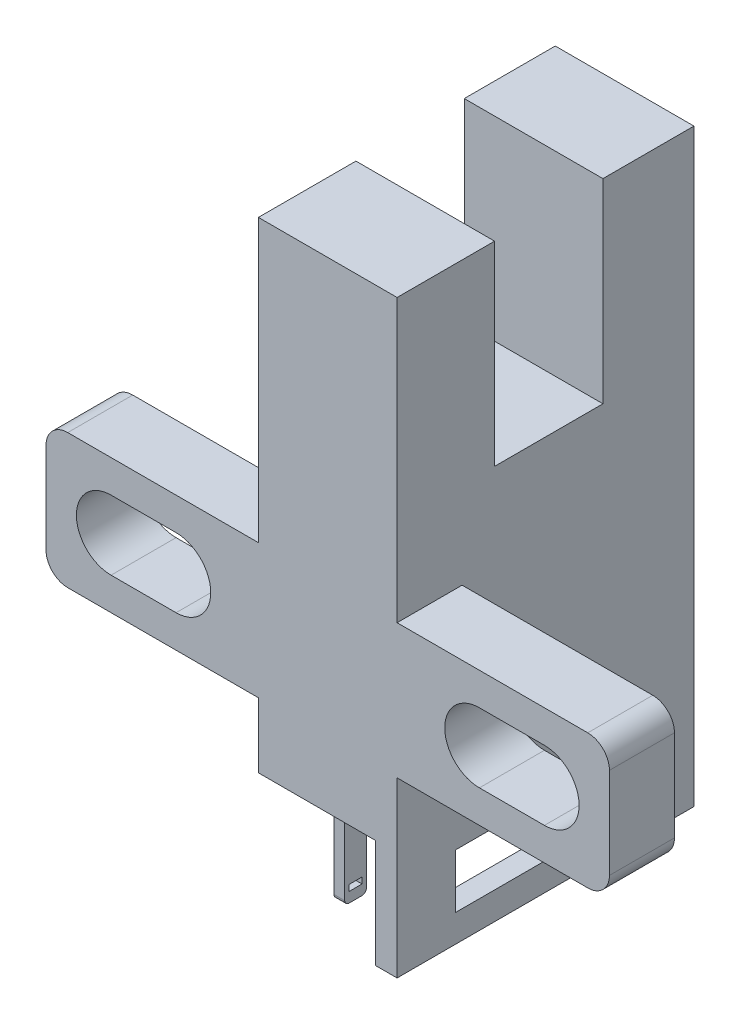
ISO-10303-21;
HEADER;
FILE_DESCRIPTION(('STEP AP214'),'2;1');
FILE_NAME('part.step','',(''),(''),'','','');
FILE_SCHEMA(('AUTOMOTIVE_DESIGN { 1 0 10303 214 1 1 1 1 }'));
ENDSEC;
DATA;
#1=APPLICATION_CONTEXT('core data for automotive mechanical design processes');
#2=APPLICATION_PROTOCOL_DEFINITION('international standard','automotive_design',2000,#1);
#3=PRODUCT_CONTEXT('',#1,'mechanical');
#4=PRODUCT('Part','Part','',(#3));
#5=PRODUCT_RELATED_PRODUCT_CATEGORY('part','',(#4));
#6=PRODUCT_DEFINITION_FORMATION('','',#4);
#7=PRODUCT_DEFINITION_CONTEXT('part definition',#1,'design');
#8=PRODUCT_DEFINITION('design','',#6,#7);
#9=PRODUCT_DEFINITION_SHAPE('','',#8);
#10=(LENGTH_UNIT() NAMED_UNIT(*) SI_UNIT(.MILLI.,.METRE.));
#11=(NAMED_UNIT(*) PLANE_ANGLE_UNIT() SI_UNIT($,.RADIAN.));
#12=(NAMED_UNIT(*) SI_UNIT($,.STERADIAN.) SOLID_ANGLE_UNIT());
#13=UNCERTAINTY_MEASURE_WITH_UNIT(LENGTH_MEASURE(1.E-05),#10,'distance_accuracy_value','');
#14=(GEOMETRIC_REPRESENTATION_CONTEXT(3) GLOBAL_UNCERTAINTY_ASSIGNED_CONTEXT((#13)) GLOBAL_UNIT_ASSIGNED_CONTEXT((#10,
#11,#12)) REPRESENTATION_CONTEXT('',''));
#15=CARTESIAN_POINT('',(0.,0.,0.));
#16=DIRECTION('',(0.,0.,1.));
#17=DIRECTION('',(1.,0.,0.));
#18=AXIS2_PLACEMENT_3D('',#15,#16,#17);
#19=CARTESIAN_POINT('',(-3.19999999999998,16.0999999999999,-10.7));
#20=DIRECTION('',(0.,0.999999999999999,0.));
#21=DIRECTION('',(0.,0.,0.999999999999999));
#22=AXIS2_PLACEMENT_3D('',#19,#20,#21);
#23=PLANE('',#22);
#24=DIRECTION('',(-1.,0.,0.));
#25=VECTOR('',#24,1.);
#26=CARTESIAN_POINT('',(-3.19999999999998,16.0999999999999,-6.50000000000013));
#27=LINE('',#26,#25);
#28=CARTESIAN_POINT('',(3.19999999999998,16.0999999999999,-6.50000000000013));
#29=VERTEX_POINT('',#28);
#30=CARTESIAN_POINT('',(-3.19999999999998,16.0999999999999,-6.50000000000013));
#31=VERTEX_POINT('',#30);
#32=EDGE_CURVE('E11',#29,#31,#27,.T.);
#33=ORIENTED_EDGE('',*,*,#32,.F.);
#34=DIRECTION('',(0.,0.,0.999999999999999));
#35=VECTOR('',#34,1.);
#36=CARTESIAN_POINT('',(3.19999999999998,16.0999999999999,-10.7));
#37=LINE('',#36,#35);
#38=CARTESIAN_POINT('',(3.19999999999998,16.0999999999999,-10.7));
#39=VERTEX_POINT('',#38);
#40=EDGE_CURVE('E1050',#39,#29,#37,.T.);
#41=ORIENTED_EDGE('',*,*,#40,.F.);
#42=DIRECTION('',(-1.,0.,0.));
#43=VECTOR('',#42,1.);
#44=CARTESIAN_POINT('',(-3.19999999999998,16.0999999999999,-10.7));
#45=LINE('',#44,#43);
#46=CARTESIAN_POINT('',(-3.19999999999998,16.0999999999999,-10.7));
#47=VERTEX_POINT('',#46);
#48=EDGE_CURVE('E1170',#39,#47,#45,.T.);
#49=ORIENTED_EDGE('',*,*,#48,.T.);
#50=DIRECTION('',(0.,0.,0.999999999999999));
#51=VECTOR('',#50,1.);
#52=CARTESIAN_POINT('',(-3.19999999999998,16.0999999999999,-10.7));
#53=LINE('',#52,#51);
#54=EDGE_CURVE('E1047',#47,#31,#53,.T.);
#55=ORIENTED_EDGE('',*,*,#54,.T.);
#56=EDGE_LOOP('',(#33,#41,#49,#55));
#57=FACE_BOUND('',#56,.T.);
#58=ADVANCED_FACE('F36',(#57),#23,.T.);
#59=CARTESIAN_POINT('',(0.,0.,3.));
#60=DIRECTION('',(0.,0.,0.999999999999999));
#61=DIRECTION('',(1.,0.,0.));
#62=AXIS2_PLACEMENT_3D('',#59,#60,#61);
#63=PLANE('',#62);
#64=DIRECTION('',(1.,0.,0.));
#65=VECTOR('',#64,1.);
#66=CARTESIAN_POINT('',(-13.,-3.10000000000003,2.99999999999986));
#67=LINE('',#66,#65);
#68=CARTESIAN_POINT('',(-12.,-3.10000000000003,2.99999999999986));
#69=VERTEX_POINT('',#68);
#70=CARTESIAN_POINT('',(-3.19999999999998,-3.10000000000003,2.99999999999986));
#71=VERTEX_POINT('',#70);
#72=EDGE_CURVE('E1078',#69,#71,#67,.T.);
#73=ORIENTED_EDGE('',*,*,#72,.T.);
#74=DIRECTION('',(0.,-0.999999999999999,0.));
#75=VECTOR('',#74,1.);
#76=CARTESIAN_POINT('',(-3.19999999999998,16.0999999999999,2.99999999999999));
#77=LINE('',#76,#75);
#78=CARTESIAN_POINT('',(-3.19999999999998,-6.10000000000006,2.99999999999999));
#79=VERTEX_POINT('',#78);
#80=EDGE_CURVE('E1165',#71,#79,#77,.T.);
#81=ORIENTED_EDGE('',*,*,#80,.T.);
#82=DIRECTION('',(1.,0.,0.));
#83=VECTOR('',#82,1.);
#84=CARTESIAN_POINT('',(-3.19999999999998,-6.10000000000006,2.99999999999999));
#85=LINE('',#84,#83);
#86=CARTESIAN_POINT('',(2.19999999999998,-6.10000000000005,2.99999999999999));
#87=VERTEX_POINT('',#86);
#88=EDGE_CURVE('E1035',#79,#87,#85,.T.);
#89=ORIENTED_EDGE('',*,*,#88,.T.);
#90=DIRECTION('',(0.,0.999999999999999,0.));
#91=VECTOR('',#90,1.);
#92=CARTESIAN_POINT('',(2.19999999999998,-11.1,3.));
#93=LINE('',#92,#91);
#94=CARTESIAN_POINT('',(2.19999999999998,-11.1,3.));
#95=VERTEX_POINT('',#94);
#96=EDGE_CURVE('E1016',#95,#87,#93,.T.);
#97=ORIENTED_EDGE('',*,*,#96,.F.);
#98=DIRECTION('',(-1.,0.,0.));
#99=VECTOR('',#98,1.);
#100=CARTESIAN_POINT('',(3.19999999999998,-11.1,3.));
#101=LINE('',#100,#99);
#102=CARTESIAN_POINT('',(3.19999999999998,-11.1,3.));
#103=VERTEX_POINT('',#102);
#104=EDGE_CURVE('E995',#103,#95,#101,.T.);
#105=ORIENTED_EDGE('',*,*,#104,.F.);
#106=DIRECTION('',(0.,0.999999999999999,0.));
#107=VECTOR('',#106,1.);
#108=CARTESIAN_POINT('',(3.19999999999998,16.0999999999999,3.));
#109=LINE('',#108,#107);
#110=CARTESIAN_POINT('',(3.19999999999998,-3.1,2.99999999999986));
#111=VERTEX_POINT('',#110);
#112=EDGE_CURVE('E1159',#103,#111,#109,.T.);
#113=ORIENTED_EDGE('',*,*,#112,.T.);
#114=CARTESIAN_POINT('',(12.,-3.1,2.99999999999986));
#115=VERTEX_POINT('',#114);
#116=EDGE_CURVE('E1077',#111,#115,#67,.T.);
#117=ORIENTED_EDGE('',*,*,#116,.T.);
#118=CARTESIAN_POINT('',(12.,-2.10000000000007,2.99999999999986));
#119=DIRECTION('',(0.,0.,0.999999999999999));
#120=DIRECTION('',(1.,0.,0.));
#121=AXIS2_PLACEMENT_3D('',#118,#119,#120);
#122=CIRCLE('',#121,1.);
#123=CARTESIAN_POINT('',(13.,-2.10000000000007,2.99999999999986));
#124=VERTEX_POINT('',#123);
#125=EDGE_CURVE('E1117',#115,#124,#122,.T.);
#126=ORIENTED_EDGE('',*,*,#125,.T.);
#127=DIRECTION('',(0.,0.999999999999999,0.));
#128=VECTOR('',#127,1.);
#129=CARTESIAN_POINT('',(13.,3.09999999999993,2.99999999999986));
#130=LINE('',#129,#128);
#131=CARTESIAN_POINT('',(13.,2.1,2.99999999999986));
#132=VERTEX_POINT('',#131);
#133=EDGE_CURVE('E1066',#124,#132,#130,.T.);
#134=ORIENTED_EDGE('',*,*,#133,.T.);
#135=CARTESIAN_POINT('',(12.,2.1,2.99999999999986));
#136=DIRECTION('',(0.,0.,0.999999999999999));
#137=DIRECTION('',(1.,0.,0.));
#138=AXIS2_PLACEMENT_3D('',#135,#136,#137);
#139=CIRCLE('',#138,1.);
#140=CARTESIAN_POINT('',(12.,3.09999999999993,2.99999999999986));
#141=VERTEX_POINT('',#140);
#142=EDGE_CURVE('E1115',#132,#141,#139,.T.);
#143=ORIENTED_EDGE('',*,*,#142,.T.);
#144=DIRECTION('',(-1.,0.,0.));
#145=VECTOR('',#144,1.);
#146=CARTESIAN_POINT('',(-13.,3.09999999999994,2.99999999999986));
#147=LINE('',#146,#145);
#148=CARTESIAN_POINT('',(3.19999999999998,3.09999999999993,2.99999999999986));
#149=VERTEX_POINT('',#148);
#150=EDGE_CURVE('E1071',#141,#149,#147,.T.);
#151=ORIENTED_EDGE('',*,*,#150,.T.);
#152=CARTESIAN_POINT('',(3.19999999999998,16.0999999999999,3.));
#153=VERTEX_POINT('',#152);
#154=EDGE_CURVE('E1021',#149,#153,#109,.T.);
#155=ORIENTED_EDGE('',*,*,#154,.T.);
#156=DIRECTION('',(-1.,0.,0.));
#157=VECTOR('',#156,1.);
#158=CARTESIAN_POINT('',(-3.19999999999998,16.0999999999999,2.99999999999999));
#159=LINE('',#158,#157);
#160=CARTESIAN_POINT('',(-3.19999999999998,16.0999999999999,2.99999999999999));
#161=VERTEX_POINT('',#160);
#162=EDGE_CURVE('E1162',#153,#161,#159,.T.);
#163=ORIENTED_EDGE('',*,*,#162,.T.);
#164=CARTESIAN_POINT('',(-3.19999999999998,3.0999999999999,2.99999999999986));
#165=VERTEX_POINT('',#164);
#166=EDGE_CURVE('E1038',#161,#165,#77,.T.);
#167=ORIENTED_EDGE('',*,*,#166,.T.);
#168=CARTESIAN_POINT('',(-12.,3.09999999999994,2.99999999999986));
#169=VERTEX_POINT('',#168);
#170=EDGE_CURVE('E1069',#165,#169,#147,.T.);
#171=ORIENTED_EDGE('',*,*,#170,.T.);
#172=CARTESIAN_POINT('',(-12.,2.09999999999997,2.99999999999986));
#173=DIRECTION('',(0.,0.,0.999999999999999));
#174=DIRECTION('',(1.,0.,0.));
#175=AXIS2_PLACEMENT_3D('',#172,#173,#174);
#176=CIRCLE('',#175,1.);
#177=CARTESIAN_POINT('',(-13.,2.09999999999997,2.99999999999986));
#178=VERTEX_POINT('',#177);
#179=EDGE_CURVE('E1113',#169,#178,#176,.T.);
#180=ORIENTED_EDGE('',*,*,#179,.T.);
#181=DIRECTION('',(0.,-0.999999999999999,0.));
#182=VECTOR('',#181,1.);
#183=CARTESIAN_POINT('',(-13.,3.09999999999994,2.99999999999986));
#184=LINE('',#183,#182);
#185=CARTESIAN_POINT('',(-13.,-2.1000000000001,2.99999999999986));
#186=VERTEX_POINT('',#185);
#187=EDGE_CURVE('E1074',#178,#186,#184,.T.);
#188=ORIENTED_EDGE('',*,*,#187,.T.);
#189=CARTESIAN_POINT('',(-12.,-2.1000000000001,2.99999999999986));
#190=DIRECTION('',(0.,0.,0.999999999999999));
#191=DIRECTION('',(1.,0.,0.));
#192=AXIS2_PLACEMENT_3D('',#189,#190,#191);
#193=CIRCLE('',#192,1.);
#194=EDGE_CURVE('E1119',#186,#69,#193,.T.);
#195=ORIENTED_EDGE('',*,*,#194,.T.);
#196=EDGE_LOOP('',(#73,#81,#89,#97,#105,#113,#117,#126,#134,#143,#151,#155,#163,#167,#171,#180,
#188,#195));
#197=FACE_BOUND('',#196,.T.);
#198=DIRECTION('',(1.,0.,0.));
#199=VECTOR('',#198,1.);
#200=CARTESIAN_POINT('',(10.,1.59999999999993,2.99999999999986));
#201=LINE('',#200,#199);
#202=CARTESIAN_POINT('',(7.00000000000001,1.59999999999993,2.99999999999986));
#203=VERTEX_POINT('',#202);
#204=CARTESIAN_POINT('',(10.,1.59999999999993,2.99999999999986));
#205=VERTEX_POINT('',#204);
#206=EDGE_CURVE('E584',#203,#205,#201,.T.);
#207=ORIENTED_EDGE('',*,*,#206,.T.);
#208=CARTESIAN_POINT('',(10.,0.,3.));
#209=DIRECTION('',(0.,0.,0.999999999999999));
#210=DIRECTION('',(1.,0.,0.));
#211=AXIS2_PLACEMENT_3D('',#208,#209,#210);
#212=CIRCLE('',#211,1.6);
#213=CARTESIAN_POINT('',(10.,-1.6,2.99999999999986));
#214=VERTEX_POINT('',#213);
#215=EDGE_CURVE('E605',#205,#214,#212,.F.);
#216=ORIENTED_EDGE('',*,*,#215,.T.);
#217=DIRECTION('',(-1.,0.,0.));
#218=VECTOR('',#217,1.);
#219=CARTESIAN_POINT('',(10.,-1.6,2.99999999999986));
#220=LINE('',#219,#218);
#221=CARTESIAN_POINT('',(7.00000000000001,-1.6,2.99999999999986));
#222=VERTEX_POINT('',#221);
#223=EDGE_CURVE('E601',#214,#222,#220,.T.);
#224=ORIENTED_EDGE('',*,*,#223,.T.);
#225=CARTESIAN_POINT('',(7.00000000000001,0.,3.));
#226=DIRECTION('',(0.,0.,0.999999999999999));
#227=DIRECTION('',(1.,0.,0.));
#228=AXIS2_PLACEMENT_3D('',#225,#226,#227);
#229=CIRCLE('',#228,1.6);
#230=EDGE_CURVE('E596',#222,#203,#229,.F.);
#231=ORIENTED_EDGE('',*,*,#230,.T.);
#232=EDGE_LOOP('',(#207,#216,#224,#231));
#233=FACE_BOUND('',#232,.T.);
#234=DIRECTION('',(-1.,0.,0.));
#235=VECTOR('',#234,1.);
#236=CARTESIAN_POINT('',(-10.,1.59999999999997,2.99999999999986));
#237=LINE('',#236,#235);
#238=CARTESIAN_POINT('',(-7.00000000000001,1.59999999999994,2.99999999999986));
#239=VERTEX_POINT('',#238);
#240=CARTESIAN_POINT('',(-10.,1.59999999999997,2.99999999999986));
#241=VERTEX_POINT('',#240);
#242=EDGE_CURVE('E569',#239,#241,#237,.T.);
#243=ORIENTED_EDGE('',*,*,#242,.F.);
#244=CARTESIAN_POINT('',(-7.00000000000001,0.,3.));
#245=DIRECTION('',(0.,0.,0.999999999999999));
#246=DIRECTION('',(1.,0.,0.));
#247=AXIS2_PLACEMENT_3D('',#244,#245,#246);
#248=CIRCLE('',#247,1.6);
#249=CARTESIAN_POINT('',(-7.00000000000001,-1.60000000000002,2.99999999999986));
#250=VERTEX_POINT('',#249);
#251=EDGE_CURVE('E572',#250,#239,#248,.T.);
#252=ORIENTED_EDGE('',*,*,#251,.F.);
#253=DIRECTION('',(1.,0.,0.));
#254=VECTOR('',#253,1.);
#255=CARTESIAN_POINT('',(-10.,-1.60000000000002,2.99999999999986));
#256=LINE('',#255,#254);
#257=CARTESIAN_POINT('',(-10.,-1.60000000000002,2.99999999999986));
#258=VERTEX_POINT('',#257);
#259=EDGE_CURVE('E563',#258,#250,#256,.T.);
#260=ORIENTED_EDGE('',*,*,#259,.F.);
#261=CARTESIAN_POINT('',(-10.,0.,3.));
#262=DIRECTION('',(0.,0.,0.999999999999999));
#263=DIRECTION('',(1.,0.,0.));
#264=AXIS2_PLACEMENT_3D('',#261,#262,#263);
#265=CIRCLE('',#264,1.6);
#266=EDGE_CURVE('E59',#241,#258,#265,.T.);
#267=ORIENTED_EDGE('',*,*,#266,.F.);
#268=EDGE_LOOP('',(#243,#252,#260,#267));
#269=FACE_BOUND('',#268,.T.);
#270=ADVANCED_FACE('F1144',(#197,#233,#269),#63,.T.);
#271=CARTESIAN_POINT('',(0.,0.,0.));
#272=DIRECTION('',(0.,0.,0.999999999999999));
#273=DIRECTION('',(1.,0.,0.));
#274=AXIS2_PLACEMENT_3D('',#271,#272,#273);
#275=PLANE('',#274);
#276=DIRECTION('',(-1.,0.,0.));
#277=VECTOR('',#276,1.);
#278=CARTESIAN_POINT('',(-13.,3.09999999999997,-1.38777878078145E-13));
#279=LINE('',#278,#277);
#280=CARTESIAN_POINT('',(-3.19999999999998,3.09999999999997,-1.38777878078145E-13));
#281=VERTEX_POINT('',#280);
#282=CARTESIAN_POINT('',(-12.,3.09999999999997,-1.38777878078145E-13));
#283=VERTEX_POINT('',#282);
#284=EDGE_CURVE('E1084',#281,#283,#279,.T.);
#285=ORIENTED_EDGE('',*,*,#284,.F.);
#286=DIRECTION('',(0.,-0.999999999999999,0.));
#287=VECTOR('',#286,1.);
#288=CARTESIAN_POINT('',(-3.19999999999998,0.,0.));
#289=LINE('',#288,#287);
#290=CARTESIAN_POINT('',(-3.19999999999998,-3.10000000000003,0.));
#291=VERTEX_POINT('',#290);
#292=EDGE_CURVE('E1025',#281,#291,#289,.T.);
#293=ORIENTED_EDGE('',*,*,#292,.T.);
#294=DIRECTION('',(1.,0.,0.));
#295=VECTOR('',#294,1.);
#296=CARTESIAN_POINT('',(-13.,-3.10000000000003,-1.38777878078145E-13));
#297=LINE('',#296,#295);
#298=CARTESIAN_POINT('',(-12.,-3.10000000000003,0.));
#299=VERTEX_POINT('',#298);
#300=EDGE_CURVE('E1070',#299,#291,#297,.T.);
#301=ORIENTED_EDGE('',*,*,#300,.F.);
#302=CARTESIAN_POINT('',(-12.,-2.10000000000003,-1.38777878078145E-13));
#303=DIRECTION('',(0.,0.,0.999999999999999));
#304=DIRECTION('',(1.,0.,0.));
#305=AXIS2_PLACEMENT_3D('',#302,#303,#304);
#306=CIRCLE('',#305,1.);
#307=CARTESIAN_POINT('',(-13.,-2.10000000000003,-1.38777878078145E-13));
#308=VERTEX_POINT('',#307);
#309=EDGE_CURVE('E1106',#299,#308,#306,.F.);
#310=ORIENTED_EDGE('',*,*,#309,.T.);
#311=DIRECTION('',(0.,-0.999999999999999,0.));
#312=VECTOR('',#311,1.);
#313=CARTESIAN_POINT('',(-13.,3.09999999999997,-1.38777878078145E-13));
#314=LINE('',#313,#312);
#315=CARTESIAN_POINT('',(-13.,2.09999999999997,-1.38777878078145E-13));
#316=VERTEX_POINT('',#315);
#317=EDGE_CURVE('E1087',#316,#308,#314,.T.);
#318=ORIENTED_EDGE('',*,*,#317,.F.);
#319=CARTESIAN_POINT('',(-12.,2.09999999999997,-1.38777878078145E-13));
#320=DIRECTION('',(0.,0.,0.999999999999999));
#321=DIRECTION('',(1.,0.,0.));
#322=AXIS2_PLACEMENT_3D('',#319,#320,#321);
#323=CIRCLE('',#322,1.);
#324=EDGE_CURVE('E1098',#316,#283,#323,.F.);
#325=ORIENTED_EDGE('',*,*,#324,.T.);
#326=EDGE_LOOP('',(#285,#293,#301,#310,#318,#325));
#327=FACE_BOUND('',#326,.T.);
#328=CARTESIAN_POINT('',(-7.00000000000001,0.,0.));
#329=DIRECTION('',(0.,0.,0.999999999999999));
#330=DIRECTION('',(-1.,0.,0.));
#331=AXIS2_PLACEMENT_3D('',#328,#329,#330);
#332=CIRCLE('',#331,1.6);
#333=CARTESIAN_POINT('',(-7.00000000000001,-1.60000000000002,-1.38777878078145E-13));
#334=VERTEX_POINT('',#333);
#335=CARTESIAN_POINT('',(-7.00000000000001,1.59999999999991,-1.38777878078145E-13));
#336=VERTEX_POINT('',#335);
#337=EDGE_CURVE('E564',#334,#336,#332,.T.);
#338=ORIENTED_EDGE('',*,*,#337,.T.);
#339=DIRECTION('',(-1.,0.,0.));
#340=VECTOR('',#339,1.);
#341=CARTESIAN_POINT('',(-10.,1.59999999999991,-1.38777878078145E-13));
#342=LINE('',#341,#340);
#343=CARTESIAN_POINT('',(-10.,1.59999999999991,-1.38777878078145E-13));
#344=VERTEX_POINT('',#343);
#345=EDGE_CURVE('E551',#336,#344,#342,.T.);
#346=ORIENTED_EDGE('',*,*,#345,.T.);
#347=CARTESIAN_POINT('',(-10.,0.,0.));
#348=DIRECTION('',(0.,0.,0.999999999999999));
#349=DIRECTION('',(1.,0.,0.));
#350=AXIS2_PLACEMENT_3D('',#347,#348,#349);
#351=CIRCLE('',#350,1.6);
#352=CARTESIAN_POINT('',(-10.,-1.60000000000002,-1.38777878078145E-13));
#353=VERTEX_POINT('',#352);
#354=EDGE_CURVE('E556',#344,#353,#351,.T.);
#355=ORIENTED_EDGE('',*,*,#354,.T.);
#356=DIRECTION('',(1.,0.,0.));
#357=VECTOR('',#356,1.);
#358=CARTESIAN_POINT('',(-10.,-1.60000000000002,-1.38777878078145E-13));
#359=LINE('',#358,#357);
#360=EDGE_CURVE('E560',#353,#334,#359,.T.);
#361=ORIENTED_EDGE('',*,*,#360,.T.);
#362=EDGE_LOOP('',(#338,#346,#355,#361));
#363=FACE_BOUND('',#362,.T.);
#364=ADVANCED_FACE('F1198',(#327,#363),#275,.F.);
#365=CARTESIAN_POINT('',(-3.19999999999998,-6.10000000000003,-10.7));
#366=DIRECTION('',(0.,-0.999999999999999,0.));
#367=DIRECTION('',(1.,0.,0.));
#368=AXIS2_PLACEMENT_3D('',#365,#366,#367);
#369=PLANE('',#368);
#370=DIRECTION('',(-1.,0.,0.));
#371=VECTOR('',#370,1.);
#372=CARTESIAN_POINT('',(-0.699999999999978,-6.10000000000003,-1.48350383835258));
#373=LINE('',#372,#371);
#374=CARTESIAN_POINT('',(-0.699999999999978,-6.10000000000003,-1.48350383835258));
#375=VERTEX_POINT('',#374);
#376=CARTESIAN_POINT('',(-1.19999999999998,-6.10000000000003,-1.48350383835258));
#377=VERTEX_POINT('',#376);
#378=EDGE_CURVE('E776',#375,#377,#373,.T.);
#379=ORIENTED_EDGE('',*,*,#378,.F.);
#380=DIRECTION('',(0.,0.,-0.999999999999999));
#381=VECTOR('',#380,1.);
#382=CARTESIAN_POINT('',(-0.699999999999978,-6.10000000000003,-1.48350383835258));
#383=LINE('',#382,#381);
#384=CARTESIAN_POINT('',(-0.699999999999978,-6.10000000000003,-2.4835038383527));
#385=VERTEX_POINT('',#384);
#386=EDGE_CURVE('E761',#375,#385,#383,.T.);
#387=ORIENTED_EDGE('',*,*,#386,.T.);
#388=DIRECTION('',(-1.,0.,0.));
#389=VECTOR('',#388,1.);
#390=CARTESIAN_POINT('',(-0.699999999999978,-6.10000000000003,-2.4835038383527));
#391=LINE('',#390,#389);
#392=CARTESIAN_POINT('',(-1.19999999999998,-6.10000000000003,-2.4835038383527));
#393=VERTEX_POINT('',#392);
#394=EDGE_CURVE('E802',#385,#393,#391,.T.);
#395=ORIENTED_EDGE('',*,*,#394,.T.);
#396=DIRECTION('',(0.,0.,-0.999999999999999));
#397=VECTOR('',#396,1.);
#398=CARTESIAN_POINT('',(-1.19999999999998,-6.10000000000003,-1.48350383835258));
#399=LINE('',#398,#397);
#400=EDGE_CURVE('E779',#377,#393,#399,.T.);
#401=ORIENTED_EDGE('',*,*,#400,.F.);
#402=EDGE_LOOP('',(#379,#387,#395,#401));
#403=FACE_BOUND('',#402,.T.);
#404=DIRECTION('',(-1.,0.,0.));
#405=VECTOR('',#404,1.);
#406=CARTESIAN_POINT('',(-0.699999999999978,-6.10000000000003,-7.48350383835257));
#407=LINE('',#406,#405);
#408=CARTESIAN_POINT('',(-0.699999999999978,-6.10000000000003,-7.48350383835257));
#409=VERTEX_POINT('',#408);
#410=CARTESIAN_POINT('',(-1.19999999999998,-6.10000000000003,-7.48350383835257));
#411=VERTEX_POINT('',#410);
#412=EDGE_CURVE('E943',#409,#411,#407,.T.);
#413=ORIENTED_EDGE('',*,*,#412,.F.);
#414=DIRECTION('',(0.,0.,0.999999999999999));
#415=VECTOR('',#414,1.);
#416=CARTESIAN_POINT('',(-0.699999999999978,-6.10000000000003,-8.48350383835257));
#417=LINE('',#416,#415);
#418=CARTESIAN_POINT('',(-0.699999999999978,-6.10000000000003,-8.48350383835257));
#419=VERTEX_POINT('',#418);
#420=EDGE_CURVE('E905',#419,#409,#417,.T.);
#421=ORIENTED_EDGE('',*,*,#420,.F.);
#422=DIRECTION('',(-1.,0.,0.));
#423=VECTOR('',#422,1.);
#424=CARTESIAN_POINT('',(-0.699999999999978,-6.10000000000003,-8.48350383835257));
#425=LINE('',#424,#423);
#426=CARTESIAN_POINT('',(-1.19999999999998,-6.10000000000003,-8.48350383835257));
#427=VERTEX_POINT('',#426);
#428=EDGE_CURVE('E946',#419,#427,#425,.T.);
#429=ORIENTED_EDGE('',*,*,#428,.T.);
#430=DIRECTION('',(0.,0.,0.999999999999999));
#431=VECTOR('',#430,1.);
#432=CARTESIAN_POINT('',(-1.19999999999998,-6.10000000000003,-8.48350383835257));
#433=LINE('',#432,#431);
#434=EDGE_CURVE('E930',#427,#411,#433,.T.);
#435=ORIENTED_EDGE('',*,*,#434,.T.);
#436=EDGE_LOOP('',(#413,#421,#429,#435));
#437=FACE_BOUND('',#436,.T.);
#438=DIRECTION('',(0.,0.,-0.999999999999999));
#439=VECTOR('',#438,1.);
#440=CARTESIAN_POINT('',(2.19999999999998,-6.10000000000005,2.99999999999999));
#441=LINE('',#440,#439);
#442=CARTESIAN_POINT('',(2.19999999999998,-6.1,-10.7));
#443=VERTEX_POINT('',#442);
#444=EDGE_CURVE('E991',#87,#443,#441,.T.);
#445=ORIENTED_EDGE('',*,*,#444,.F.);
#446=ORIENTED_EDGE('',*,*,#88,.F.);
#447=DIRECTION('',(0.,0.,0.999999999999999));
#448=VECTOR('',#447,1.);
#449=CARTESIAN_POINT('',(-3.19999999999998,-6.10000000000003,-10.7));
#450=LINE('',#449,#448);
#451=CARTESIAN_POINT('',(-3.19999999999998,-6.10000000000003,-10.7));
#452=VERTEX_POINT('',#451);
#453=EDGE_CURVE('E1043',#452,#79,#450,.T.);
#454=ORIENTED_EDGE('',*,*,#453,.F.);
#455=DIRECTION('',(1.,0.,0.));
#456=VECTOR('',#455,1.);
#457=CARTESIAN_POINT('',(-3.19999999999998,-6.10000000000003,-10.7));
#458=LINE('',#457,#456);
#459=EDGE_CURVE('E1011',#452,#443,#458,.T.);
#460=ORIENTED_EDGE('',*,*,#459,.T.);
#461=EDGE_LOOP('',(#445,#446,#454,#460));
#462=FACE_BOUND('',#461,.T.);
#463=DIRECTION('',(-1.,0.,0.));
#464=VECTOR('',#463,1.);
#465=CARTESIAN_POINT('',(-0.699999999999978,-6.1000000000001,-4.48350383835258));
#466=LINE('',#465,#464);
#467=CARTESIAN_POINT('',(-0.699999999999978,-6.1000000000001,-4.48350383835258));
#468=VERTEX_POINT('',#467);
#469=CARTESIAN_POINT('',(-1.19999999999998,-6.1000000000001,-4.48350383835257));
#470=VERTEX_POINT('',#469);
#471=EDGE_CURVE('E824',#468,#470,#466,.T.);
#472=ORIENTED_EDGE('',*,*,#471,.F.);
#473=DIRECTION('',(0.,0.,-0.999999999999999));
#474=VECTOR('',#473,1.);
#475=CARTESIAN_POINT('',(-0.699999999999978,-6.1000000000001,-4.48350383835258));
#476=LINE('',#475,#474);
#477=CARTESIAN_POINT('',(-0.699999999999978,-6.1000000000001,-5.48350383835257));
#478=VERTEX_POINT('',#477);
#479=EDGE_CURVE('E809',#468,#478,#476,.T.);
#480=ORIENTED_EDGE('',*,*,#479,.T.);
#481=DIRECTION('',(-1.,0.,0.));
#482=VECTOR('',#481,1.);
#483=CARTESIAN_POINT('',(-0.699999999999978,-6.1000000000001,-5.48350383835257));
#484=LINE('',#483,#482);
#485=CARTESIAN_POINT('',(-1.19999999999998,-6.1000000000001,-5.48350383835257));
#486=VERTEX_POINT('',#485);
#487=EDGE_CURVE('E850',#478,#486,#484,.T.);
#488=ORIENTED_EDGE('',*,*,#487,.T.);
#489=DIRECTION('',(0.,0.,-0.999999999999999));
#490=VECTOR('',#489,1.);
#491=CARTESIAN_POINT('',(-1.19999999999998,-6.1000000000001,-4.48350383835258));
#492=LINE('',#491,#490);
#493=EDGE_CURVE('E827',#470,#486,#492,.T.);
#494=ORIENTED_EDGE('',*,*,#493,.F.);
#495=EDGE_LOOP('',(#472,#480,#488,#494));
#496=FACE_BOUND('',#495,.T.);
#497=DIRECTION('',(-1.,0.,0.));
#498=VECTOR('',#497,1.);
#499=CARTESIAN_POINT('',(-0.699999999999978,-6.10000000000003,1.5164961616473));
#500=LINE('',#499,#498);
#501=CARTESIAN_POINT('',(-0.699999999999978,-6.10000000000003,1.5164961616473));
#502=VERTEX_POINT('',#501);
#503=CARTESIAN_POINT('',(-1.19999999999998,-6.10000000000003,1.5164961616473));
#504=VERTEX_POINT('',#503);
#505=EDGE_CURVE('E728',#502,#504,#500,.T.);
#506=ORIENTED_EDGE('',*,*,#505,.F.);
#507=DIRECTION('',(0.,0.,-0.999999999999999));
#508=VECTOR('',#507,1.);
#509=CARTESIAN_POINT('',(-0.699999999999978,-6.10000000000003,1.5164961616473));
#510=LINE('',#509,#508);
#511=CARTESIAN_POINT('',(-0.699999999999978,-6.10000000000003,0.516496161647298));
#512=VERTEX_POINT('',#511);
#513=EDGE_CURVE('E713',#502,#512,#510,.T.);
#514=ORIENTED_EDGE('',*,*,#513,.T.);
#515=DIRECTION('',(-1.,0.,0.));
#516=VECTOR('',#515,1.);
#517=CARTESIAN_POINT('',(-0.699999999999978,-6.10000000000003,0.516496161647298));
#518=LINE('',#517,#516);
#519=CARTESIAN_POINT('',(-1.19999999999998,-6.10000000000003,0.516496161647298));
#520=VERTEX_POINT('',#519);
#521=EDGE_CURVE('E754',#512,#520,#518,.T.);
#522=ORIENTED_EDGE('',*,*,#521,.T.);
#523=DIRECTION('',(0.,0.,-0.999999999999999));
#524=VECTOR('',#523,1.);
#525=CARTESIAN_POINT('',(-1.19999999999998,-6.10000000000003,1.5164961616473));
#526=LINE('',#525,#524);
#527=EDGE_CURVE('E731',#504,#520,#526,.T.);
#528=ORIENTED_EDGE('',*,*,#527,.F.);
#529=EDGE_LOOP('',(#506,#514,#522,#528));
#530=FACE_BOUND('',#529,.T.);
#531=ADVANCED_FACE('F1195',(#403,#437,#462,#496,#530),#369,.T.);
#532=CARTESIAN_POINT('',(-13.,3.09999999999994,2.99999999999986));
#533=DIRECTION('',(0.,-0.999999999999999,0.));
#534=DIRECTION('',(0.,0.,-0.999999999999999));
#535=AXIS2_PLACEMENT_3D('',#532,#533,#534);
#536=PLANE('',#535);
#537=CARTESIAN_POINT('',(12.,3.1,-1.38777878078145E-13));
#538=VERTEX_POINT('',#537);
#539=CARTESIAN_POINT('',(3.19999999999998,3.1,-1.38777878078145E-13));
#540=VERTEX_POINT('',#539);
#541=EDGE_CURVE('E1085',#538,#540,#279,.T.);
#542=ORIENTED_EDGE('',*,*,#541,.T.);
#543=DIRECTION('',(0.,0.,0.999999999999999));
#544=VECTOR('',#543,1.);
#545=CARTESIAN_POINT('',(3.19999999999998,3.09999999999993,2.99999999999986));
#546=LINE('',#545,#544);
#547=EDGE_CURVE('E1062',#540,#149,#546,.T.);
#548=ORIENTED_EDGE('',*,*,#547,.T.);
#549=ORIENTED_EDGE('',*,*,#150,.F.);
#550=DIRECTION('',(0.,0.,-0.999999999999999));
#551=VECTOR('',#550,1.);
#552=CARTESIAN_POINT('',(12.,3.09999999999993,2.99999999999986));
#553=LINE('',#552,#551);
#554=EDGE_CURVE('E1032',#141,#538,#553,.T.);
#555=ORIENTED_EDGE('',*,*,#554,.T.);
#556=EDGE_LOOP('',(#542,#548,#549,#555));
#557=FACE_BOUND('',#556,.T.);
#558=ADVANCED_FACE('F1132',(#557),#536,.F.);
#559=CARTESIAN_POINT('',(-13.,-3.10000000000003,2.99999999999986));
#560=DIRECTION('',(0.,0.999999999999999,0.));
#561=DIRECTION('',(0.,0.,0.999999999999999));
#562=AXIS2_PLACEMENT_3D('',#559,#560,#561);
#563=PLANE('',#562);
#564=ORIENTED_EDGE('',*,*,#116,.F.);
#565=DIRECTION('',(0.,0.,-0.999999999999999));
#566=VECTOR('',#565,1.);
#567=CARTESIAN_POINT('',(3.19999999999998,-3.1,2.99999999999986));
#568=LINE('',#567,#566);
#569=CARTESIAN_POINT('',(3.19999999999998,-3.10000000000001,0.));
#570=VERTEX_POINT('',#569);
#571=EDGE_CURVE('E1059',#111,#570,#568,.T.);
#572=ORIENTED_EDGE('',*,*,#571,.T.);
#573=CARTESIAN_POINT('',(12.,-3.10000000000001,0.));
#574=VERTEX_POINT('',#573);
#575=EDGE_CURVE('E1090',#570,#574,#297,.T.);
#576=ORIENTED_EDGE('',*,*,#575,.T.);
#577=DIRECTION('',(0.,0.,-0.999999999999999));
#578=VECTOR('',#577,1.);
#579=CARTESIAN_POINT('',(12.,-3.1,2.99999999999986));
#580=LINE('',#579,#578);
#581=EDGE_CURVE('E1081',#574,#115,#580,.F.);
#582=ORIENTED_EDGE('',*,*,#581,.T.);
#583=EDGE_LOOP('',(#564,#572,#576,#582));
#584=FACE_BOUND('',#583,.T.);
#585=ADVANCED_FACE('F1153',(#584),#563,.F.);
#586=CARTESIAN_POINT('',(10.,0.,0.));
#587=DIRECTION('',(0.,0.,-0.999999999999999));
#588=DIRECTION('',(-1.,0.,0.));
#589=AXIS2_PLACEMENT_3D('',#586,#587,#588);
#590=CIRCLE('',#589,1.6);
#591=CARTESIAN_POINT('',(10.,1.59999999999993,0.));
#592=VERTEX_POINT('',#591);
#593=CARTESIAN_POINT('',(10.,-1.6,0.));
#594=VERTEX_POINT('',#593);
#595=EDGE_CURVE('E585',#592,#594,#590,.T.);
#596=ORIENTED_EDGE('',*,*,#595,.F.);
#597=DIRECTION('',(1.,0.,0.));
#598=VECTOR('',#597,1.);
#599=CARTESIAN_POINT('',(10.,1.59999999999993,0.));
#600=LINE('',#599,#598);
#601=CARTESIAN_POINT('',(7.00000000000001,1.59999999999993,0.));
#602=VERTEX_POINT('',#601);
#603=EDGE_CURVE('E588',#602,#592,#600,.T.);
#604=ORIENTED_EDGE('',*,*,#603,.F.);
#605=CARTESIAN_POINT('',(7.00000000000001,0.,0.));
#606=DIRECTION('',(0.,0.,-0.999999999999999));
#607=DIRECTION('',(1.,0.,0.));
#608=AXIS2_PLACEMENT_3D('',#605,#606,#607);
#609=CIRCLE('',#608,1.6);
#610=CARTESIAN_POINT('',(7.00000000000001,-1.6,0.));
#611=VERTEX_POINT('',#610);
#612=EDGE_CURVE('E568',#611,#602,#609,.T.);
#613=ORIENTED_EDGE('',*,*,#612,.F.);
#614=DIRECTION('',(-1.,0.,0.));
#615=VECTOR('',#614,1.);
#616=CARTESIAN_POINT('',(10.,-1.6,0.));
#617=LINE('',#616,#615);
#618=EDGE_CURVE('E582',#594,#611,#617,.T.);
#619=ORIENTED_EDGE('',*,*,#618,.F.);
#620=EDGE_LOOP('',(#596,#604,#613,#619));
#621=FACE_BOUND('',#620,.T.);
#622=ORIENTED_EDGE('',*,*,#575,.F.);
#623=DIRECTION('',(0.,0.999999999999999,0.));
#624=VECTOR('',#623,1.);
#625=CARTESIAN_POINT('',(3.19999999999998,0.,0.));
#626=LINE('',#625,#624);
#627=EDGE_CURVE('E1023',#570,#540,#626,.T.);
#628=ORIENTED_EDGE('',*,*,#627,.T.);
#629=ORIENTED_EDGE('',*,*,#541,.F.);
#630=CARTESIAN_POINT('',(12.,2.09999999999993,0.));
#631=DIRECTION('',(0.,0.,0.999999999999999));
#632=DIRECTION('',(1.,0.,0.));
#633=AXIS2_PLACEMENT_3D('',#630,#631,#632);
#634=CIRCLE('',#633,1.);
#635=CARTESIAN_POINT('',(13.,2.09999999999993,0.));
#636=VERTEX_POINT('',#635);
#637=EDGE_CURVE('E1101',#538,#636,#634,.F.);
#638=ORIENTED_EDGE('',*,*,#637,.T.);
#639=DIRECTION('',(0.,0.999999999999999,0.));
#640=VECTOR('',#639,1.);
#641=CARTESIAN_POINT('',(13.,3.1,0.));
#642=LINE('',#641,#640);
#643=CARTESIAN_POINT('',(13.,-2.10000000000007,0.));
#644=VERTEX_POINT('',#643);
#645=EDGE_CURVE('E1065',#644,#636,#642,.T.);
#646=ORIENTED_EDGE('',*,*,#645,.F.);
#647=CARTESIAN_POINT('',(12.,-2.10000000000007,0.));
#648=DIRECTION('',(0.,0.,0.999999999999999));
#649=DIRECTION('',(1.,0.,0.));
#650=AXIS2_PLACEMENT_3D('',#647,#648,#649);
#651=CIRCLE('',#650,1.);
#652=EDGE_CURVE('E1103',#644,#574,#651,.F.);
#653=ORIENTED_EDGE('',*,*,#652,.T.);
#654=EDGE_LOOP('',(#622,#628,#629,#638,#646,#653));
#655=FACE_BOUND('',#654,.T.);
#656=ADVANCED_FACE('F1135',(#621,#655),#275,.F.);
#657=CARTESIAN_POINT('',(13.,3.09999999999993,2.99999999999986));
#658=DIRECTION('',(-1.,0.,0.));
#659=DIRECTION('',(0.,0.,0.999999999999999));
#660=AXIS2_PLACEMENT_3D('',#657,#658,#659);
#661=PLANE('',#660);
#662=ORIENTED_EDGE('',*,*,#133,.F.);
#663=DIRECTION('',(0.,0.,-0.999999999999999));
#664=VECTOR('',#663,1.);
#665=CARTESIAN_POINT('',(13.,-2.10000000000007,2.99999999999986));
#666=LINE('',#665,#664);
#667=EDGE_CURVE('E1123',#124,#644,#666,.T.);
#668=ORIENTED_EDGE('',*,*,#667,.T.);
#669=ORIENTED_EDGE('',*,*,#645,.T.);
#670=DIRECTION('',(0.,0.,-0.999999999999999));
#671=VECTOR('',#670,1.);
#672=CARTESIAN_POINT('',(13.,2.1,2.99999999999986));
#673=LINE('',#672,#671);
#674=EDGE_CURVE('E1121',#636,#132,#673,.F.);
#675=ORIENTED_EDGE('',*,*,#674,.T.);
#676=EDGE_LOOP('',(#662,#668,#669,#675));
#677=FACE_BOUND('',#676,.T.);
#678=ADVANCED_FACE('F1140',(#677),#661,.F.);
#679=ORIENTED_EDGE('',*,*,#170,.F.);
#680=DIRECTION('',(0.,0.,-0.999999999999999));
#681=VECTOR('',#680,1.);
#682=CARTESIAN_POINT('',(-3.19999999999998,3.0999999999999,2.99999999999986));
#683=LINE('',#682,#681);
#684=EDGE_CURVE('E1056',#165,#281,#683,.T.);
#685=ORIENTED_EDGE('',*,*,#684,.T.);
#686=ORIENTED_EDGE('',*,*,#284,.T.);
#687=DIRECTION('',(0.,0.,-0.999999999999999));
#688=VECTOR('',#687,1.);
#689=CARTESIAN_POINT('',(-12.,3.09999999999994,2.99999999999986));
#690=LINE('',#689,#688);
#691=EDGE_CURVE('E1126',#283,#169,#690,.F.);
#692=ORIENTED_EDGE('',*,*,#691,.T.);
#693=EDGE_LOOP('',(#679,#685,#686,#692));
#694=FACE_BOUND('',#693,.T.);
#695=ADVANCED_FACE('F1904',(#694),#536,.F.);
#696=CARTESIAN_POINT('',(-13.,3.09999999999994,2.99999999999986));
#697=DIRECTION('',(1.,0.,0.));
#698=DIRECTION('',(0.,0.,-0.999999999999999));
#699=AXIS2_PLACEMENT_3D('',#696,#697,#698);
#700=PLANE('',#699);
#701=ORIENTED_EDGE('',*,*,#317,.T.);
#702=DIRECTION('',(0.,0.,-0.999999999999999));
#703=VECTOR('',#702,1.);
#704=CARTESIAN_POINT('',(-13.,-2.1000000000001,2.99999999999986));
#705=LINE('',#704,#703);
#706=EDGE_CURVE('E1111',#308,#186,#705,.F.);
#707=ORIENTED_EDGE('',*,*,#706,.T.);
#708=ORIENTED_EDGE('',*,*,#187,.F.);
#709=DIRECTION('',(0.,0.,-0.999999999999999));
#710=VECTOR('',#709,1.);
#711=CARTESIAN_POINT('',(-13.,2.09999999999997,2.99999999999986));
#712=LINE('',#711,#710);
#713=EDGE_CURVE('E1108',#178,#316,#712,.T.);
#714=ORIENTED_EDGE('',*,*,#713,.T.);
#715=EDGE_LOOP('',(#701,#707,#708,#714));
#716=FACE_BOUND('',#715,.T.);
#717=ADVANCED_FACE('F1894',(#716),#700,.F.);
#718=ORIENTED_EDGE('',*,*,#300,.T.);
#719=DIRECTION('',(0.,0.,0.999999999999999));
#720=VECTOR('',#719,1.);
#721=CARTESIAN_POINT('',(-3.19999999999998,-3.10000000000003,2.99999999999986));
#722=LINE('',#721,#720);
#723=EDGE_CURVE('E1046',#291,#71,#722,.T.);
#724=ORIENTED_EDGE('',*,*,#723,.T.);
#725=ORIENTED_EDGE('',*,*,#72,.F.);
#726=DIRECTION('',(0.,0.,-0.999999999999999));
#727=VECTOR('',#726,1.);
#728=CARTESIAN_POINT('',(-12.,-3.10000000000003,2.99999999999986));
#729=LINE('',#728,#727);
#730=EDGE_CURVE('E1095',#69,#299,#729,.T.);
#731=ORIENTED_EDGE('',*,*,#730,.T.);
#732=EDGE_LOOP('',(#718,#724,#725,#731));
#733=FACE_BOUND('',#732,.T.);
#734=ADVANCED_FACE('F1884',(#733),#563,.F.);
#735=CARTESIAN_POINT('',(-12.,-2.1000000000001,2.99999999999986));
#736=DIRECTION('',(0.,0.,-0.999999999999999));
#737=DIRECTION('',(-1.,0.,0.));
#738=AXIS2_PLACEMENT_3D('',#735,#736,#737);
#739=CYLINDRICAL_SURFACE('',#738,1.);
#740=ORIENTED_EDGE('',*,*,#194,.F.);
#741=ORIENTED_EDGE('',*,*,#706,.F.);
#742=ORIENTED_EDGE('',*,*,#309,.F.);
#743=ORIENTED_EDGE('',*,*,#730,.F.);
#744=EDGE_LOOP('',(#740,#741,#742,#743));
#745=FACE_BOUND('',#744,.T.);
#746=ADVANCED_FACE('F1875',(#745),#739,.T.);
#747=CARTESIAN_POINT('',(12.,-2.10000000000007,2.99999999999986));
#748=DIRECTION('',(0.,0.,-0.999999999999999));
#749=DIRECTION('',(-1.,0.,0.));
#750=AXIS2_PLACEMENT_3D('',#747,#748,#749);
#751=CYLINDRICAL_SURFACE('',#750,1.);
#752=ORIENTED_EDGE('',*,*,#125,.F.);
#753=ORIENTED_EDGE('',*,*,#581,.F.);
#754=ORIENTED_EDGE('',*,*,#652,.F.);
#755=ORIENTED_EDGE('',*,*,#667,.F.);
#756=EDGE_LOOP('',(#752,#753,#754,#755));
#757=FACE_BOUND('',#756,.T.);
#758=ADVANCED_FACE('F1149',(#757),#751,.T.);
#759=CARTESIAN_POINT('',(12.,2.1,2.99999999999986));
#760=DIRECTION('',(0.,0.,-0.999999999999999));
#761=DIRECTION('',(-1.,0.,0.));
#762=AXIS2_PLACEMENT_3D('',#759,#760,#761);
#763=CYLINDRICAL_SURFACE('',#762,1.);
#764=ORIENTED_EDGE('',*,*,#142,.F.);
#765=ORIENTED_EDGE('',*,*,#674,.F.);
#766=ORIENTED_EDGE('',*,*,#637,.F.);
#767=ORIENTED_EDGE('',*,*,#554,.F.);
#768=EDGE_LOOP('',(#764,#765,#766,#767));
#769=FACE_BOUND('',#768,.T.);
#770=ADVANCED_FACE('F1142',(#769),#763,.T.);
#771=CARTESIAN_POINT('',(-12.,2.09999999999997,2.99999999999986));
#772=DIRECTION('',(0.,0.,-0.999999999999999));
#773=DIRECTION('',(-1.,0.,0.));
#774=AXIS2_PLACEMENT_3D('',#771,#772,#773);
#775=CYLINDRICAL_SURFACE('',#774,1.);
#776=ORIENTED_EDGE('',*,*,#179,.F.);
#777=ORIENTED_EDGE('',*,*,#691,.F.);
#778=ORIENTED_EDGE('',*,*,#324,.F.);
#779=ORIENTED_EDGE('',*,*,#713,.F.);
#780=EDGE_LOOP('',(#776,#777,#778,#779));
#781=FACE_BOUND('',#780,.T.);
#782=ADVANCED_FACE('F38',(#781),#775,.T.);
#783=CARTESIAN_POINT('',(3.19999999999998,16.0999999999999,-10.7));
#784=DIRECTION('',(1.,0.,0.));
#785=DIRECTION('',(0.,0.999999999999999,0.));
#786=AXIS2_PLACEMENT_3D('',#783,#784,#785);
#787=PLANE('',#786);
#788=DIRECTION('',(0.,-0.999999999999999,0.));
#789=VECTOR('',#788,1.);
#790=CARTESIAN_POINT('',(3.19999999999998,25.1,-6.50000000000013));
#791=LINE('',#790,#789);
#792=CARTESIAN_POINT('',(3.19999999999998,7.09999999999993,-6.50000000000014));
#793=VERTEX_POINT('',#792);
#794=EDGE_CURVE('E535',#29,#793,#791,.T.);
#795=ORIENTED_EDGE('',*,*,#794,.T.);
#796=DIRECTION('',(0.,0.,0.999999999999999));
#797=VECTOR('',#796,1.);
#798=CARTESIAN_POINT('',(3.19999999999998,7.09999999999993,-6.50000000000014));
#799=LINE('',#798,#797);
#800=CARTESIAN_POINT('',(3.19999999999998,7.09999999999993,-1.50000000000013));
#801=VERTEX_POINT('',#800);
#802=EDGE_CURVE('E525',#793,#801,#799,.T.);
#803=ORIENTED_EDGE('',*,*,#802,.T.);
#804=DIRECTION('',(0.,0.999999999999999,0.));
#805=VECTOR('',#804,1.);
#806=CARTESIAN_POINT('',(3.19999999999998,25.1,-1.50000000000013));
#807=LINE('',#806,#805);
#808=CARTESIAN_POINT('',(3.19999999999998,16.0999999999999,-1.5));
#809=VERTEX_POINT('',#808);
#810=EDGE_CURVE('E522',#801,#809,#807,.T.);
#811=ORIENTED_EDGE('',*,*,#810,.T.);
#812=EDGE_CURVE('E1053',#809,#153,#37,.T.);
#813=ORIENTED_EDGE('',*,*,#812,.T.);
#814=ORIENTED_EDGE('',*,*,#154,.F.);
#815=ORIENTED_EDGE('',*,*,#547,.F.);
#816=ORIENTED_EDGE('',*,*,#627,.F.);
#817=ORIENTED_EDGE('',*,*,#571,.F.);
#818=ORIENTED_EDGE('',*,*,#112,.F.);
#819=DIRECTION('',(0.,0.,0.999999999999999));
#820=VECTOR('',#819,1.);
#821=CARTESIAN_POINT('',(3.19999999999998,-11.1,3.));
#822=LINE('',#821,#820);
#823=CARTESIAN_POINT('',(3.19999999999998,-11.1,-10.7000000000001));
#824=VERTEX_POINT('',#823);
#825=EDGE_CURVE('E992',#824,#103,#822,.T.);
#826=ORIENTED_EDGE('',*,*,#825,.F.);
#827=DIRECTION('',(0.,0.999999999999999,0.));
#828=VECTOR('',#827,1.);
#829=CARTESIAN_POINT('',(3.19999999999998,16.0999999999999,-10.7));
#830=LINE('',#829,#828);
#831=EDGE_CURVE('E1005',#824,#39,#830,.T.);
#832=ORIENTED_EDGE('',*,*,#831,.T.);
#833=ORIENTED_EDGE('',*,*,#40,.T.);
#834=EDGE_LOOP('',(#795,#803,#811,#813,#814,#815,#816,#817,#818,#826,#832,#833));
#835=FACE_BOUND('',#834,.T.);
#836=DIRECTION('',(0.,-0.999999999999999,0.));
#837=VECTOR('',#836,1.);
#838=CARTESIAN_POINT('',(3.19999999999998,16.0999999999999,0.29999999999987));
#839=LINE('',#838,#837);
#840=CARTESIAN_POINT('',(3.19999999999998,-7.3297517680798,0.29999999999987));
#841=VERTEX_POINT('',#840);
#842=CARTESIAN_POINT('',(3.19999999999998,-9.82975176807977,0.299999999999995));
#843=VERTEX_POINT('',#842);
#844=EDGE_CURVE('E989',#841,#843,#839,.T.);
#845=ORIENTED_EDGE('',*,*,#844,.F.);
#846=DIRECTION('',(0.,0.,0.999999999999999));
#847=VECTOR('',#846,1.);
#848=CARTESIAN_POINT('',(3.19999999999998,-7.3297517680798,-10.7000000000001));
#849=LINE('',#848,#847);
#850=CARTESIAN_POINT('',(3.19999999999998,-7.3297517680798,-7.7));
#851=VERTEX_POINT('',#850);
#852=EDGE_CURVE('E976',#851,#841,#849,.T.);
#853=ORIENTED_EDGE('',*,*,#852,.F.);
#854=DIRECTION('',(0.,0.999999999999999,0.));
#855=VECTOR('',#854,1.);
#856=CARTESIAN_POINT('',(3.19999999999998,16.0999999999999,-7.7));
#857=LINE('',#856,#855);
#858=CARTESIAN_POINT('',(3.19999999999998,-9.82975176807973,-7.7));
#859=VERTEX_POINT('',#858);
#860=EDGE_CURVE('E984',#859,#851,#857,.T.);
#861=ORIENTED_EDGE('',*,*,#860,.F.);
#862=DIRECTION('',(0.,0.,-0.999999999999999));
#863=VECTOR('',#862,1.);
#864=CARTESIAN_POINT('',(3.19999999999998,-9.82975176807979,-10.7000000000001));
#865=LINE('',#864,#863);
#866=EDGE_CURVE('E987',#843,#859,#865,.T.);
#867=ORIENTED_EDGE('',*,*,#866,.F.);
#868=EDGE_LOOP('',(#845,#853,#861,#867));
#869=FACE_BOUND('',#868,.T.);
#870=ADVANCED_FACE('F1156',(#835,#869),#787,.T.);
#871=CARTESIAN_POINT('',(-3.19999999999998,16.0999999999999,-10.7));
#872=DIRECTION('',(-1.,0.,0.));
#873=DIRECTION('',(0.,-0.999999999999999,0.));
#874=AXIS2_PLACEMENT_3D('',#871,#872,#873);
#875=PLANE('',#874);
#876=DIRECTION('',(0.,-0.999999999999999,0.));
#877=VECTOR('',#876,1.);
#878=CARTESIAN_POINT('',(-3.19999999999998,25.1,-6.50000000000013));
#879=LINE('',#878,#877);
#880=CARTESIAN_POINT('',(-3.19999999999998,7.0999999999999,-6.50000000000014));
#881=VERTEX_POINT('',#880);
#882=EDGE_CURVE('E536',#31,#881,#879,.T.);
#883=ORIENTED_EDGE('',*,*,#882,.F.);
#884=ORIENTED_EDGE('',*,*,#54,.F.);
#885=DIRECTION('',(0.,-0.999999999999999,0.));
#886=VECTOR('',#885,1.);
#887=CARTESIAN_POINT('',(-3.19999999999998,16.0999999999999,-10.7));
#888=LINE('',#887,#886);
#889=EDGE_CURVE('E1168',#47,#452,#888,.T.);
#890=ORIENTED_EDGE('',*,*,#889,.T.);
#891=ORIENTED_EDGE('',*,*,#453,.T.);
#892=ORIENTED_EDGE('',*,*,#80,.F.);
#893=ORIENTED_EDGE('',*,*,#723,.F.);
#894=ORIENTED_EDGE('',*,*,#292,.F.);
#895=ORIENTED_EDGE('',*,*,#684,.F.);
#896=ORIENTED_EDGE('',*,*,#166,.F.);
#897=CARTESIAN_POINT('',(-3.19999999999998,16.0999999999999,-1.5));
#898=VERTEX_POINT('',#897);
#899=EDGE_CURVE('E541',#898,#161,#53,.T.);
#900=ORIENTED_EDGE('',*,*,#899,.F.);
#901=DIRECTION('',(0.,0.999999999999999,0.));
#902=VECTOR('',#901,1.);
#903=CARTESIAN_POINT('',(-3.19999999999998,25.1,-1.50000000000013));
#904=LINE('',#903,#902);
#905=CARTESIAN_POINT('',(-3.19999999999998,7.0999999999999,-1.50000000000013));
#906=VERTEX_POINT('',#905);
#907=EDGE_CURVE('E51',#906,#898,#904,.T.);
#908=ORIENTED_EDGE('',*,*,#907,.F.);
#909=DIRECTION('',(0.,0.,0.999999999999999));
#910=VECTOR('',#909,1.);
#911=CARTESIAN_POINT('',(-3.19999999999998,7.0999999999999,-6.50000000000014));
#912=LINE('',#911,#910);
#913=EDGE_CURVE('E529',#881,#906,#912,.T.);
#914=ORIENTED_EDGE('',*,*,#913,.F.);
#915=EDGE_LOOP('',(#883,#884,#890,#891,#892,#893,#894,#895,#896,#900,#908,#914));
#916=FACE_BOUND('',#915,.T.);
#917=ADVANCED_FACE('F539',(#916),#875,.T.);
#918=DIRECTION('',(1.,0.,0.));
#919=VECTOR('',#918,1.);
#920=CARTESIAN_POINT('',(-3.19999999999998,16.0999999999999,-1.5));
#921=LINE('',#920,#919);
#922=EDGE_CURVE('E44',#898,#809,#921,.T.);
#923=ORIENTED_EDGE('',*,*,#922,.F.);
#924=ORIENTED_EDGE('',*,*,#899,.T.);
#925=ORIENTED_EDGE('',*,*,#162,.F.);
#926=ORIENTED_EDGE('',*,*,#812,.F.);
#927=EDGE_LOOP('',(#923,#924,#925,#926));
#928=FACE_BOUND('',#927,.T.);
#929=ADVANCED_FACE('F1191',(#928),#23,.T.);
#930=CARTESIAN_POINT('',(0.,0.,-10.7000000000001));
#931=DIRECTION('',(0.,0.,0.999999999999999));
#932=DIRECTION('',(1.,0.,0.));
#933=AXIS2_PLACEMENT_3D('',#930,#931,#932);
#934=PLANE('',#933);
#935=ORIENTED_EDGE('',*,*,#831,.F.);
#936=DIRECTION('',(1.,0.,0.));
#937=VECTOR('',#936,1.);
#938=CARTESIAN_POINT('',(3.19999999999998,-11.1,-10.7000000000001));
#939=LINE('',#938,#937);
#940=CARTESIAN_POINT('',(2.19999999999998,-11.1,-10.7000000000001));
#941=VERTEX_POINT('',#940);
#942=EDGE_CURVE('E999',#941,#824,#939,.T.);
#943=ORIENTED_EDGE('',*,*,#942,.F.);
#944=DIRECTION('',(0.,0.999999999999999,0.));
#945=VECTOR('',#944,1.);
#946=CARTESIAN_POINT('',(2.19999999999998,-11.1,-10.7000000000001));
#947=LINE('',#946,#945);
#948=EDGE_CURVE('E1002',#941,#443,#947,.T.);
#949=ORIENTED_EDGE('',*,*,#948,.T.);
#950=ORIENTED_EDGE('',*,*,#459,.F.);
#951=ORIENTED_EDGE('',*,*,#889,.F.);
#952=ORIENTED_EDGE('',*,*,#48,.F.);
#953=EDGE_LOOP('',(#935,#943,#949,#950,#951,#952));
#954=FACE_BOUND('',#953,.T.);
#955=ADVANCED_FACE('F1177',(#954),#934,.F.);
#956=CARTESIAN_POINT('',(2.19999999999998,-11.1,3.));
#957=DIRECTION('',(1.,0.,0.));
#958=DIRECTION('',(0.,0.,-0.999999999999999));
#959=AXIS2_PLACEMENT_3D('',#956,#957,#958);
#960=PLANE('',#959);
#961=DIRECTION('',(0.,0.,-0.999999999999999));
#962=VECTOR('',#961,1.);
#963=CARTESIAN_POINT('',(2.19999999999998,-7.32975176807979,-7.7));
#964=LINE('',#963,#962);
#965=CARTESIAN_POINT('',(2.19999999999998,-7.3297517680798,0.29999999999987));
#966=VERTEX_POINT('',#965);
#967=CARTESIAN_POINT('',(2.19999999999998,-7.32975176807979,-7.7));
#968=VERTEX_POINT('',#967);
#969=EDGE_CURVE('E964',#966,#968,#964,.T.);
#970=ORIENTED_EDGE('',*,*,#969,.F.);
#971=DIRECTION('',(0.,0.999999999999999,0.));
#972=VECTOR('',#971,1.);
#973=CARTESIAN_POINT('',(2.19999999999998,-7.3297517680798,0.29999999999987));
#974=LINE('',#973,#972);
#975=CARTESIAN_POINT('',(2.19999999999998,-9.82975176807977,0.299999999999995));
#976=VERTEX_POINT('',#975);
#977=EDGE_CURVE('E962',#976,#966,#974,.T.);
#978=ORIENTED_EDGE('',*,*,#977,.F.);
#979=DIRECTION('',(0.,0.,0.999999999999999));
#980=VECTOR('',#979,1.);
#981=CARTESIAN_POINT('',(2.19999999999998,-9.82975176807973,-7.7));
#982=LINE('',#981,#980);
#983=CARTESIAN_POINT('',(2.19999999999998,-9.82975176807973,-7.7));
#984=VERTEX_POINT('',#983);
#985=EDGE_CURVE('E970',#984,#976,#982,.T.);
#986=ORIENTED_EDGE('',*,*,#985,.F.);
#987=DIRECTION('',(0.,-0.999999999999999,0.));
#988=VECTOR('',#987,1.);
#989=CARTESIAN_POINT('',(2.19999999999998,-7.32975176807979,-7.7));
#990=LINE('',#989,#988);
#991=EDGE_CURVE('E967',#968,#984,#990,.T.);
#992=ORIENTED_EDGE('',*,*,#991,.F.);
#993=EDGE_LOOP('',(#970,#978,#986,#992));
#994=FACE_BOUND('',#993,.T.);
#995=ORIENTED_EDGE('',*,*,#444,.T.);
#996=ORIENTED_EDGE('',*,*,#948,.F.);
#997=DIRECTION('',(0.,0.,-0.999999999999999));
#998=VECTOR('',#997,1.);
#999=CARTESIAN_POINT('',(2.19999999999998,-11.1,3.));
#1000=LINE('',#999,#998);
#1001=EDGE_CURVE('E997',#95,#941,#1000,.T.);
#1002=ORIENTED_EDGE('',*,*,#1001,.F.);
#1003=ORIENTED_EDGE('',*,*,#96,.T.);
#1004=EDGE_LOOP('',(#995,#996,#1002,#1003));
#1005=FACE_BOUND('',#1004,.T.);
#1006=ADVANCED_FACE('F1184',(#994,#1005),#960,.F.);
#1007=CARTESIAN_POINT('',(0.,-11.1000000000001,0.));
#1008=DIRECTION('',(0.,0.999999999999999,0.));
#1009=DIRECTION('',(-1.,0.,0.));
#1010=AXIS2_PLACEMENT_3D('',#1007,#1008,#1009);
#1011=PLANE('',#1010);
#1012=ORIENTED_EDGE('',*,*,#825,.T.);
#1013=ORIENTED_EDGE('',*,*,#104,.T.);
#1014=ORIENTED_EDGE('',*,*,#1001,.T.);
#1015=ORIENTED_EDGE('',*,*,#942,.T.);
#1016=EDGE_LOOP('',(#1012,#1013,#1014,#1015));
#1017=FACE_BOUND('',#1016,.T.);
#1018=ADVANCED_FACE('F1180',(#1017),#1011,.F.);
#1019=CARTESIAN_POINT('',(7.19999999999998,-7.3297517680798,0.29999999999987));
#1020=DIRECTION('',(0.,0.,0.999999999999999));
#1021=DIRECTION('',(1.,0.,0.));
#1022=AXIS2_PLACEMENT_3D('',#1019,#1020,#1021);
#1023=PLANE('',#1022);
#1024=ORIENTED_EDGE('',*,*,#844,.T.);
#1025=DIRECTION('',(-1.,0.,0.));
#1026=VECTOR('',#1025,1.);
#1027=CARTESIAN_POINT('',(7.19999999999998,-9.82975176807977,0.299999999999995));
#1028=LINE('',#1027,#1026);
#1029=EDGE_CURVE('E974',#843,#976,#1028,.T.);
#1030=ORIENTED_EDGE('',*,*,#1029,.T.);
#1031=ORIENTED_EDGE('',*,*,#977,.T.);
#1032=DIRECTION('',(-1.,0.,0.));
#1033=VECTOR('',#1032,1.);
#1034=CARTESIAN_POINT('',(7.19999999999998,-7.3297517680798,0.29999999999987));
#1035=LINE('',#1034,#1033);
#1036=EDGE_CURVE('E973',#841,#966,#1035,.T.);
#1037=ORIENTED_EDGE('',*,*,#1036,.F.);
#1038=EDGE_LOOP('',(#1024,#1030,#1031,#1037));
#1039=FACE_BOUND('',#1038,.T.);
#1040=ADVANCED_FACE('F1261',(#1039),#1023,.F.);
#1041=CARTESIAN_POINT('',(7.19999999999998,-9.82975176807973,-7.7));
#1042=DIRECTION('',(0.,-0.999999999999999,0.));
#1043=DIRECTION('',(1.,0.,0.));
#1044=AXIS2_PLACEMENT_3D('',#1041,#1042,#1043);
#1045=PLANE('',#1044);
#1046=ORIENTED_EDGE('',*,*,#866,.T.);
#1047=DIRECTION('',(-1.,0.,0.));
#1048=VECTOR('',#1047,1.);
#1049=CARTESIAN_POINT('',(7.19999999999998,-9.82975176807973,-7.7));
#1050=LINE('',#1049,#1048);
#1051=EDGE_CURVE('E977',#859,#984,#1050,.T.);
#1052=ORIENTED_EDGE('',*,*,#1051,.T.);
#1053=ORIENTED_EDGE('',*,*,#985,.T.);
#1054=ORIENTED_EDGE('',*,*,#1029,.F.);
#1055=EDGE_LOOP('',(#1046,#1052,#1053,#1054));
#1056=FACE_BOUND('',#1055,.T.);
#1057=ADVANCED_FACE('F1264',(#1056),#1045,.F.);
#1058=CARTESIAN_POINT('',(7.19999999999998,-7.3297517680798,-7.7));
#1059=DIRECTION('',(0.,0.,-0.999999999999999));
#1060=DIRECTION('',(-1.,0.,0.));
#1061=AXIS2_PLACEMENT_3D('',#1058,#1059,#1060);
#1062=PLANE('',#1061);
#1063=ORIENTED_EDGE('',*,*,#860,.T.);
#1064=DIRECTION('',(-1.,0.,0.));
#1065=VECTOR('',#1064,1.);
#1066=CARTESIAN_POINT('',(7.19999999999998,-7.3297517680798,-7.7));
#1067=LINE('',#1066,#1065);
#1068=EDGE_CURVE('E979',#851,#968,#1067,.T.);
#1069=ORIENTED_EDGE('',*,*,#1068,.T.);
#1070=ORIENTED_EDGE('',*,*,#991,.T.);
#1071=ORIENTED_EDGE('',*,*,#1051,.F.);
#1072=EDGE_LOOP('',(#1063,#1069,#1070,#1071));
#1073=FACE_BOUND('',#1072,.T.);
#1074=ADVANCED_FACE('F1270',(#1073),#1062,.F.);
#1075=CARTESIAN_POINT('',(7.19999999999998,-7.3297517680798,-7.7));
#1076=DIRECTION('',(0.,0.999999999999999,0.));
#1077=DIRECTION('',(-1.,0.,0.));
#1078=AXIS2_PLACEMENT_3D('',#1075,#1076,#1077);
#1079=PLANE('',#1078);
#1080=ORIENTED_EDGE('',*,*,#852,.T.);
#1081=ORIENTED_EDGE('',*,*,#1036,.T.);
#1082=ORIENTED_EDGE('',*,*,#969,.T.);
#1083=ORIENTED_EDGE('',*,*,#1068,.F.);
#1084=EDGE_LOOP('',(#1080,#1081,#1082,#1083));
#1085=FACE_BOUND('',#1084,.T.);
#1086=ADVANCED_FACE('F1266',(#1085),#1079,.F.);
#1087=CARTESIAN_POINT('',(-0.699999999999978,-10.723972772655,-9.07365783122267));
#1088=DIRECTION('',(-1.,0.,0.));
#1089=DIRECTION('',(0.,-0.999999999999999,0.));
#1090=AXIS2_PLACEMENT_3D('',#1087,#1088,#1089);
#1091=CYLINDRICAL_SURFACE('',#1090,0.209846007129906);
#1092=CARTESIAN_POINT('',(-1.19999999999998,-10.723972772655,-9.07365783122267));
#1093=DIRECTION('',(-1.,0.,0.));
#1094=DIRECTION('',(0.,-0.999999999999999,0.));
#1095=AXIS2_PLACEMENT_3D('',#1092,#1093,#1094);
#1096=CIRCLE('',#1095,0.209846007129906);
#1097=CARTESIAN_POINT('',(-1.19999999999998,-10.723972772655,-9.28350383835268));
#1098=VERTEX_POINT('',#1097);
#1099=CARTESIAN_POINT('',(-1.19999999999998,-10.9338187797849,-9.07365783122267));
#1100=VERTEX_POINT('',#1099);
#1101=EDGE_CURVE('E879',#1098,#1100,#1096,.T.);
#1102=ORIENTED_EDGE('',*,*,#1101,.F.);
#1103=DIRECTION('',(-1.,0.,0.));
#1104=VECTOR('',#1103,1.);
#1105=CARTESIAN_POINT('',(-0.699999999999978,-10.723972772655,-9.28350383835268));
#1106=LINE('',#1105,#1104);
#1107=CARTESIAN_POINT('',(-0.699999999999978,-10.723972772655,-9.28350383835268));
#1108=VERTEX_POINT('',#1107);
#1109=EDGE_CURVE('E957',#1108,#1098,#1106,.T.);
#1110=ORIENTED_EDGE('',*,*,#1109,.F.);
#1111=CARTESIAN_POINT('',(-0.699999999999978,-10.723972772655,-9.07365783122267));
#1112=DIRECTION('',(-1.,0.,0.));
#1113=DIRECTION('',(0.,-0.999999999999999,0.));
#1114=AXIS2_PLACEMENT_3D('',#1111,#1112,#1113);
#1115=CIRCLE('',#1114,0.209846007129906);
#1116=CARTESIAN_POINT('',(-0.699999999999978,-10.9338187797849,-9.07365783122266));
#1117=VERTEX_POINT('',#1116);
#1118=EDGE_CURVE('E888',#1108,#1117,#1115,.T.);
#1119=ORIENTED_EDGE('',*,*,#1118,.T.);
#1120=DIRECTION('',(-1.,0.,0.));
#1121=VECTOR('',#1120,1.);
#1122=CARTESIAN_POINT('',(-0.699999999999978,-10.9338187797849,-9.07365783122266));
#1123=LINE('',#1122,#1121);
#1124=EDGE_CURVE('E959',#1117,#1100,#1123,.T.);
#1125=ORIENTED_EDGE('',*,*,#1124,.T.);
#1126=EDGE_LOOP('',(#1102,#1110,#1119,#1125));
#1127=FACE_BOUND('',#1126,.T.);
#1128=ADVANCED_FACE('F1269',(#1127),#1091,.T.);
#1129=CARTESIAN_POINT('',(-0.699999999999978,-10.723972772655,-9.28350383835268));
#1130=DIRECTION('',(0.,0.,0.999999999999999));
#1131=DIRECTION('',(1.,0.,0.));
#1132=AXIS2_PLACEMENT_3D('',#1129,#1130,#1131);
#1133=PLANE('',#1132);
#1134=DIRECTION('',(0.,0.999999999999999,0.));
#1135=VECTOR('',#1134,1.);
#1136=CARTESIAN_POINT('',(-1.19999999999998,-10.723972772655,-9.28350383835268));
#1137=LINE('',#1136,#1135);
#1138=CARTESIAN_POINT('',(-1.19999999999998,-10.3436647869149,-9.28350383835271));
#1139=VERTEX_POINT('',#1138);
#1140=EDGE_CURVE('E916',#1098,#1139,#1137,.T.);
#1141=ORIENTED_EDGE('',*,*,#1140,.T.);
#1142=DIRECTION('',(-1.,0.,0.));
#1143=VECTOR('',#1142,1.);
#1144=CARTESIAN_POINT('',(-0.699999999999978,-10.3436647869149,-9.28350383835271));
#1145=LINE('',#1144,#1143);
#1146=CARTESIAN_POINT('',(-0.699999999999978,-10.3436647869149,-9.28350383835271));
#1147=VERTEX_POINT('',#1146);
#1148=EDGE_CURVE('E954',#1147,#1139,#1145,.T.);
#1149=ORIENTED_EDGE('',*,*,#1148,.F.);
#1150=DIRECTION('',(0.,0.999999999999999,0.));
#1151=VECTOR('',#1150,1.);
#1152=CARTESIAN_POINT('',(-0.699999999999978,-10.723972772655,-9.28350383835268));
#1153=LINE('',#1152,#1151);
#1154=EDGE_CURVE('E892',#1108,#1147,#1153,.T.);
#1155=ORIENTED_EDGE('',*,*,#1154,.F.);
#1156=ORIENTED_EDGE('',*,*,#1109,.T.);
#1157=EDGE_LOOP('',(#1141,#1149,#1155,#1156));
#1158=FACE_BOUND('',#1157,.T.);
#1159=ADVANCED_FACE('F1280',(#1158),#1133,.F.);
#1160=CARTESIAN_POINT('',(-0.699999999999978,-10.3436647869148,-9.07365783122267));
#1161=DIRECTION('',(-1.,0.,0.));
#1162=DIRECTION('',(0.,-0.999999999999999,0.));
#1163=AXIS2_PLACEMENT_3D('',#1160,#1161,#1162);
#1164=CYLINDRICAL_SURFACE('',#1163,0.209846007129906);
#1165=CARTESIAN_POINT('',(-1.19999999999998,-10.3436647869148,-9.07365783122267));
#1166=DIRECTION('',(1.,0.,0.));
#1167=DIRECTION('',(0.,0.999999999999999,0.));
#1168=AXIS2_PLACEMENT_3D('',#1165,#1166,#1167);
#1169=CIRCLE('',#1168,0.209846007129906);
#1170=CARTESIAN_POINT('',(-1.19999999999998,-10.1338187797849,-9.07365783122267));
#1171=VERTEX_POINT('',#1170);
#1172=EDGE_CURVE('E918',#1139,#1171,#1169,.T.);
#1173=ORIENTED_EDGE('',*,*,#1172,.T.);
#1174=DIRECTION('',(-1.,0.,0.));
#1175=VECTOR('',#1174,1.);
#1176=CARTESIAN_POINT('',(-0.699999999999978,-10.1338187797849,-9.07365783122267));
#1177=LINE('',#1176,#1175);
#1178=CARTESIAN_POINT('',(-0.699999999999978,-10.1338187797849,-9.07365783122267));
#1179=VERTEX_POINT('',#1178);
#1180=EDGE_CURVE('E952',#1179,#1171,#1177,.T.);
#1181=ORIENTED_EDGE('',*,*,#1180,.F.);
#1182=CARTESIAN_POINT('',(-0.699999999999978,-10.3436647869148,-9.07365783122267));
#1183=DIRECTION('',(1.,0.,0.));
#1184=DIRECTION('',(0.,0.999999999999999,0.));
#1185=AXIS2_PLACEMENT_3D('',#1182,#1183,#1184);
#1186=CIRCLE('',#1185,0.209846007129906);
#1187=EDGE_CURVE('E894',#1147,#1179,#1186,.T.);
#1188=ORIENTED_EDGE('',*,*,#1187,.F.);
#1189=ORIENTED_EDGE('',*,*,#1148,.T.);
#1190=EDGE_LOOP('',(#1173,#1181,#1188,#1189));
#1191=FACE_BOUND('',#1190,.T.);
#1192=ADVANCED_FACE('F1284',(#1191),#1164,.T.);
#1193=CARTESIAN_POINT('',(-0.699999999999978,-10.133818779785,-8.69334984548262));
#1194=DIRECTION('',(0.,0.999999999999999,0.));
#1195=DIRECTION('',(-1.,0.,0.));
#1196=AXIS2_PLACEMENT_3D('',#1193,#1194,#1195);
#1197=PLANE('',#1196);
#1198=DIRECTION('',(0.,0.,-0.999999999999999));
#1199=VECTOR('',#1198,1.);
#1200=CARTESIAN_POINT('',(-1.19999999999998,-10.133818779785,-8.69334984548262));
#1201=LINE('',#1200,#1199);
#1202=CARTESIAN_POINT('',(-1.19999999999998,-10.133818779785,-8.69334984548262));
#1203=VERTEX_POINT('',#1202);
#1204=EDGE_CURVE('E921',#1203,#1171,#1201,.T.);
#1205=ORIENTED_EDGE('',*,*,#1204,.F.);
#1206=DIRECTION('',(-1.,0.,0.));
#1207=VECTOR('',#1206,1.);
#1208=CARTESIAN_POINT('',(-0.699999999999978,-10.133818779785,-8.69334984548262));
#1209=LINE('',#1208,#1207);
#1210=CARTESIAN_POINT('',(-0.699999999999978,-10.133818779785,-8.69334984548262));
#1211=VERTEX_POINT('',#1210);
#1212=EDGE_CURVE('E950',#1211,#1203,#1209,.T.);
#1213=ORIENTED_EDGE('',*,*,#1212,.F.);
#1214=DIRECTION('',(0.,0.,-0.999999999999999));
#1215=VECTOR('',#1214,1.);
#1216=CARTESIAN_POINT('',(-0.699999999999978,-10.133818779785,-8.69334984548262));
#1217=LINE('',#1216,#1215);
#1218=EDGE_CURVE('E896',#1211,#1179,#1217,.T.);
#1219=ORIENTED_EDGE('',*,*,#1218,.T.);
#1220=ORIENTED_EDGE('',*,*,#1180,.T.);
#1221=EDGE_LOOP('',(#1205,#1213,#1219,#1220));
#1222=FACE_BOUND('',#1221,.T.);
#1223=ADVANCED_FACE('F1288',(#1222),#1197,.T.);
#1224=CARTESIAN_POINT('',(-0.699999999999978,-9.92397277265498,-8.69334984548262));
#1225=DIRECTION('',(-1.,0.,0.));
#1226=DIRECTION('',(0.,-0.999999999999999,0.));
#1227=AXIS2_PLACEMENT_3D('',#1224,#1225,#1226);
#1228=CYLINDRICAL_SURFACE('',#1227,0.209846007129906);
#1229=CARTESIAN_POINT('',(-1.19999999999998,-9.92397277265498,-8.69334984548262));
#1230=DIRECTION('',(1.,0.,0.));
#1231=DIRECTION('',(0.,0.999999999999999,0.));
#1232=AXIS2_PLACEMENT_3D('',#1229,#1230,#1231);
#1233=CIRCLE('',#1232,0.209846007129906);
#1234=CARTESIAN_POINT('',(-1.19999999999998,-9.92397277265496,-8.48350383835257));
#1235=VERTEX_POINT('',#1234);
#1236=EDGE_CURVE('E924',#1235,#1203,#1233,.T.);
#1237=ORIENTED_EDGE('',*,*,#1236,.F.);
#1238=DIRECTION('',(-1.,0.,0.));
#1239=VECTOR('',#1238,1.);
#1240=CARTESIAN_POINT('',(-0.699999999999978,-9.92397277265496,-8.48350383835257));
#1241=LINE('',#1240,#1239);
#1242=CARTESIAN_POINT('',(-0.699999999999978,-9.92397277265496,-8.48350383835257));
#1243=VERTEX_POINT('',#1242);
#1244=EDGE_CURVE('E948',#1243,#1235,#1241,.T.);
#1245=ORIENTED_EDGE('',*,*,#1244,.F.);
#1246=CARTESIAN_POINT('',(-0.699999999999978,-9.92397277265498,-8.69334984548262));
#1247=DIRECTION('',(1.,0.,0.));
#1248=DIRECTION('',(0.,0.999999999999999,0.));
#1249=AXIS2_PLACEMENT_3D('',#1246,#1247,#1248);
#1250=CIRCLE('',#1249,0.209846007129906);
#1251=EDGE_CURVE('E899',#1243,#1211,#1250,.T.);
#1252=ORIENTED_EDGE('',*,*,#1251,.T.);
#1253=ORIENTED_EDGE('',*,*,#1212,.T.);
#1254=EDGE_LOOP('',(#1237,#1245,#1252,#1253));
#1255=FACE_BOUND('',#1254,.T.);
#1256=ADVANCED_FACE('F1292',(#1255),#1228,.F.);
#1257=CARTESIAN_POINT('',(-0.699999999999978,-6.10000000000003,-8.48350383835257));
#1258=DIRECTION('',(0.,0.,-0.999999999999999));
#1259=DIRECTION('',(-1.,0.,0.));
#1260=AXIS2_PLACEMENT_3D('',#1257,#1258,#1259);
#1261=PLANE('',#1260);
#1262=DIRECTION('',(0.,-0.999999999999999,0.));
#1263=VECTOR('',#1262,1.);
#1264=CARTESIAN_POINT('',(-1.19999999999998,-6.10000000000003,-8.48350383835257));
#1265=LINE('',#1264,#1263);
#1266=EDGE_CURVE('E927',#427,#1235,#1265,.T.);
#1267=ORIENTED_EDGE('',*,*,#1266,.F.);
#1268=ORIENTED_EDGE('',*,*,#428,.F.);
#1269=DIRECTION('',(0.,-0.999999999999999,0.));
#1270=VECTOR('',#1269,1.);
#1271=CARTESIAN_POINT('',(-0.699999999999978,-6.10000000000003,-8.48350383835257));
#1272=LINE('',#1271,#1270);
#1273=EDGE_CURVE('E902',#419,#1243,#1272,.T.);
#1274=ORIENTED_EDGE('',*,*,#1273,.T.);
#1275=ORIENTED_EDGE('',*,*,#1244,.T.);
#1276=EDGE_LOOP('',(#1267,#1268,#1274,#1275));
#1277=FACE_BOUND('',#1276,.T.);
#1278=ADVANCED_FACE('F1296',(#1277),#1261,.T.);
#1279=CARTESIAN_POINT('',(-0.699999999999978,-10.2120601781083,-7.48350383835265));
#1280=DIRECTION('',(0.,0.,-0.999999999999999));
#1281=DIRECTION('',(-1.,0.,0.));
#1282=AXIS2_PLACEMENT_3D('',#1279,#1280,#1281);
#1283=PLANE('',#1282);
#1284=DIRECTION('',(0.,-0.999999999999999,0.));
#1285=VECTOR('',#1284,1.);
#1286=CARTESIAN_POINT('',(-1.19999999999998,-10.2120601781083,-7.48350383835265));
#1287=LINE('',#1286,#1285);
#1288=CARTESIAN_POINT('',(-1.19999999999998,-10.7239727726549,-7.48350383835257));
#1289=VERTEX_POINT('',#1288);
#1290=EDGE_CURVE('E932',#411,#1289,#1287,.T.);
#1291=ORIENTED_EDGE('',*,*,#1290,.T.);
#1292=DIRECTION('',(-1.,0.,0.));
#1293=VECTOR('',#1292,1.);
#1294=CARTESIAN_POINT('',(-0.699999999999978,-10.7239727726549,-7.48350383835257));
#1295=LINE('',#1294,#1293);
#1296=CARTESIAN_POINT('',(-0.699999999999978,-10.7239727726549,-7.48350383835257));
#1297=VERTEX_POINT('',#1296);
#1298=EDGE_CURVE('E940',#1297,#1289,#1295,.T.);
#1299=ORIENTED_EDGE('',*,*,#1298,.F.);
#1300=DIRECTION('',(0.,-0.999999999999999,0.));
#1301=VECTOR('',#1300,1.);
#1302=CARTESIAN_POINT('',(-0.699999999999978,-6.10000000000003,-7.48350383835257));
#1303=LINE('',#1302,#1301);
#1304=EDGE_CURVE('E908',#409,#1297,#1303,.T.);
#1305=ORIENTED_EDGE('',*,*,#1304,.F.);
#1306=ORIENTED_EDGE('',*,*,#412,.T.);
#1307=EDGE_LOOP('',(#1291,#1299,#1305,#1306));
#1308=FACE_BOUND('',#1307,.T.);
#1309=ADVANCED_FACE('F1300',(#1308),#1283,.F.);
#1310=CARTESIAN_POINT('',(-0.699999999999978,-10.723972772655,-7.69334984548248));
#1311=DIRECTION('',(-1.,0.,0.));
#1312=DIRECTION('',(0.,-0.999999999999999,0.));
#1313=AXIS2_PLACEMENT_3D('',#1310,#1311,#1312);
#1314=CYLINDRICAL_SURFACE('',#1313,0.209846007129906);
#1315=CARTESIAN_POINT('',(-1.19999999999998,-10.723972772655,-7.69334984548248));
#1316=DIRECTION('',(1.,0.,0.));
#1317=DIRECTION('',(0.,0.999999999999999,0.));
#1318=AXIS2_PLACEMENT_3D('',#1315,#1316,#1317);
#1319=CIRCLE('',#1318,0.209846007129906);
#1320=CARTESIAN_POINT('',(-1.19999999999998,-10.9338187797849,-7.69334984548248));
#1321=VERTEX_POINT('',#1320);
#1322=EDGE_CURVE('E934',#1289,#1321,#1319,.T.);
#1323=ORIENTED_EDGE('',*,*,#1322,.T.);
#1324=DIRECTION('',(-1.,0.,0.));
#1325=VECTOR('',#1324,1.);
#1326=CARTESIAN_POINT('',(-0.699999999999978,-10.9338187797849,-7.69334984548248));
#1327=LINE('',#1326,#1325);
#1328=CARTESIAN_POINT('',(-0.699999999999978,-10.9338187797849,-7.69334984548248));
#1329=VERTEX_POINT('',#1328);
#1330=EDGE_CURVE('E913',#1329,#1321,#1327,.T.);
#1331=ORIENTED_EDGE('',*,*,#1330,.F.);
#1332=CARTESIAN_POINT('',(-0.699999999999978,-10.723972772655,-7.69334984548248));
#1333=DIRECTION('',(1.,0.,0.));
#1334=DIRECTION('',(0.,0.999999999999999,0.));
#1335=AXIS2_PLACEMENT_3D('',#1332,#1333,#1334);
#1336=CIRCLE('',#1335,0.209846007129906);
#1337=EDGE_CURVE('E910',#1297,#1329,#1336,.T.);
#1338=ORIENTED_EDGE('',*,*,#1337,.F.);
#1339=ORIENTED_EDGE('',*,*,#1298,.T.);
#1340=EDGE_LOOP('',(#1323,#1331,#1338,#1339));
#1341=FACE_BOUND('',#1340,.T.);
#1342=ADVANCED_FACE('F1304',(#1341),#1314,.T.);
#1343=CARTESIAN_POINT('',(-0.699999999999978,-10.933818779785,-8.48350383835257));
#1344=DIRECTION('',(0.,-0.999999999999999,0.));
#1345=DIRECTION('',(1.,0.,0.));
#1346=AXIS2_PLACEMENT_3D('',#1343,#1344,#1345);
#1347=PLANE('',#1346);
#1348=DIRECTION('',(0.,0.,0.999999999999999));
#1349=VECTOR('',#1348,1.);
#1350=CARTESIAN_POINT('',(-1.19999999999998,-10.933818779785,-8.48350383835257));
#1351=LINE('',#1350,#1349);
#1352=EDGE_CURVE('E889',#1100,#1321,#1351,.T.);
#1353=ORIENTED_EDGE('',*,*,#1352,.F.);
#1354=ORIENTED_EDGE('',*,*,#1124,.F.);
#1355=DIRECTION('',(0.,0.,-0.999999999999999));
#1356=VECTOR('',#1355,1.);
#1357=CARTESIAN_POINT('',(-0.699999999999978,-10.933818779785,-8.48350383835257));
#1358=LINE('',#1357,#1356);
#1359=EDGE_CURVE('E886',#1329,#1117,#1358,.T.);
#1360=ORIENTED_EDGE('',*,*,#1359,.F.);
#1361=ORIENTED_EDGE('',*,*,#1330,.T.);
#1362=EDGE_LOOP('',(#1353,#1354,#1360,#1361));
#1363=FACE_BOUND('',#1362,.T.);
#1364=ADVANCED_FACE('F1308',(#1363),#1347,.T.);
#1365=CARTESIAN_POINT('',(-0.699999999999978,-10.723972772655,-9.07365783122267));
#1366=DIRECTION('',(-1.,0.,0.));
#1367=DIRECTION('',(0.,-0.999999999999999,0.));
#1368=AXIS2_PLACEMENT_3D('',#1365,#1366,#1367);
#1369=PLANE('',#1368);
#1370=DIRECTION('',(0.,0.,0.999999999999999));
#1371=VECTOR('',#1370,1.);
#1372=CARTESIAN_POINT('',(-0.699999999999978,-10.6725638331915,-8.78350383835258));
#1373=LINE('',#1372,#1371);
#1374=CARTESIAN_POINT('',(-0.699999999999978,-10.6725638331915,-8.78350383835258));
#1375=VERTEX_POINT('',#1374);
#1376=CARTESIAN_POINT('',(-0.699999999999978,-10.6725638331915,-7.98350383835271));
#1377=VERTEX_POINT('',#1376);
#1378=EDGE_CURVE('E864',#1375,#1377,#1373,.T.);
#1379=ORIENTED_EDGE('',*,*,#1378,.T.);
#1380=DIRECTION('',(0.,0.999999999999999,0.));
#1381=VECTOR('',#1380,1.);
#1382=CARTESIAN_POINT('',(-0.699999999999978,-10.3725638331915,-7.98350383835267));
#1383=LINE('',#1382,#1381);
#1384=CARTESIAN_POINT('',(-0.699999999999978,-10.3725638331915,-7.98350383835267));
#1385=VERTEX_POINT('',#1384);
#1386=EDGE_CURVE('E854',#1377,#1385,#1383,.T.);
#1387=ORIENTED_EDGE('',*,*,#1386,.T.);
#1388=DIRECTION('',(0.,0.,-0.999999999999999));
#1389=VECTOR('',#1388,1.);
#1390=CARTESIAN_POINT('',(-0.699999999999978,-10.3725638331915,-8.78350383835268));
#1391=LINE('',#1390,#1389);
#1392=CARTESIAN_POINT('',(-0.699999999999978,-10.3725638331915,-8.78350383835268));
#1393=VERTEX_POINT('',#1392);
#1394=EDGE_CURVE('E857',#1385,#1393,#1391,.T.);
#1395=ORIENTED_EDGE('',*,*,#1394,.T.);
#1396=DIRECTION('',(0.,-0.999999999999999,0.));
#1397=VECTOR('',#1396,1.);
#1398=CARTESIAN_POINT('',(-0.699999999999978,-10.3725638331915,-8.78350383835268));
#1399=LINE('',#1398,#1397);
#1400=EDGE_CURVE('E861',#1393,#1375,#1399,.T.);
#1401=ORIENTED_EDGE('',*,*,#1400,.T.);
#1402=EDGE_LOOP('',(#1379,#1387,#1395,#1401));
#1403=FACE_BOUND('',#1402,.T.);
#1404=ORIENTED_EDGE('',*,*,#1359,.T.);
#1405=ORIENTED_EDGE('',*,*,#1118,.F.);
#1406=ORIENTED_EDGE('',*,*,#1154,.T.);
#1407=ORIENTED_EDGE('',*,*,#1187,.T.);
#1408=ORIENTED_EDGE('',*,*,#1218,.F.);
#1409=ORIENTED_EDGE('',*,*,#1251,.F.);
#1410=ORIENTED_EDGE('',*,*,#1273,.F.);
#1411=ORIENTED_EDGE('',*,*,#420,.T.);
#1412=ORIENTED_EDGE('',*,*,#1304,.T.);
#1413=ORIENTED_EDGE('',*,*,#1337,.T.);
#1414=EDGE_LOOP('',(#1404,#1405,#1406,#1407,#1408,#1409,#1410,#1411,#1412,#1413));
#1415=FACE_BOUND('',#1414,.T.);
#1416=ADVANCED_FACE('F1312',(#1403,#1415),#1369,.F.);
#1417=CARTESIAN_POINT('',(-1.19999999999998,-10.723972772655,-9.07365783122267));
#1418=DIRECTION('',(-1.,0.,0.));
#1419=DIRECTION('',(0.,-0.999999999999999,0.));
#1420=AXIS2_PLACEMENT_3D('',#1417,#1418,#1419);
#1421=PLANE('',#1420);
#1422=DIRECTION('',(0.,0.999999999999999,0.));
#1423=VECTOR('',#1422,1.);
#1424=CARTESIAN_POINT('',(-1.19999999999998,-10.3725638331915,-7.98350383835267));
#1425=LINE('',#1424,#1423);
#1426=CARTESIAN_POINT('',(-1.19999999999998,-10.6725638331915,-7.98350383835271));
#1427=VERTEX_POINT('',#1426);
#1428=CARTESIAN_POINT('',(-1.19999999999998,-10.3725638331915,-7.98350383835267));
#1429=VERTEX_POINT('',#1428);
#1430=EDGE_CURVE('E843',#1427,#1429,#1425,.T.);
#1431=ORIENTED_EDGE('',*,*,#1430,.F.);
#1432=DIRECTION('',(0.,0.,0.999999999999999));
#1433=VECTOR('',#1432,1.);
#1434=CARTESIAN_POINT('',(-1.19999999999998,-10.6725638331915,-8.78350383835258));
#1435=LINE('',#1434,#1433);
#1436=CARTESIAN_POINT('',(-1.19999999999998,-10.6725638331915,-8.78350383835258));
#1437=VERTEX_POINT('',#1436);
#1438=EDGE_CURVE('E858',#1437,#1427,#1435,.T.);
#1439=ORIENTED_EDGE('',*,*,#1438,.F.);
#1440=DIRECTION('',(0.,-0.999999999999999,0.));
#1441=VECTOR('',#1440,1.);
#1442=CARTESIAN_POINT('',(-1.19999999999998,-10.3725638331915,-8.78350383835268));
#1443=LINE('',#1442,#1441);
#1444=CARTESIAN_POINT('',(-1.19999999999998,-10.3725638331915,-8.78350383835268));
#1445=VERTEX_POINT('',#1444);
#1446=EDGE_CURVE('E872',#1445,#1437,#1443,.T.);
#1447=ORIENTED_EDGE('',*,*,#1446,.F.);
#1448=DIRECTION('',(0.,0.,-0.999999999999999));
#1449=VECTOR('',#1448,1.);
#1450=CARTESIAN_POINT('',(-1.19999999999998,-10.3725638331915,-8.78350383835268));
#1451=LINE('',#1450,#1449);
#1452=EDGE_CURVE('E869',#1429,#1445,#1451,.T.);
#1453=ORIENTED_EDGE('',*,*,#1452,.F.);
#1454=EDGE_LOOP('',(#1431,#1439,#1447,#1453));
#1455=FACE_BOUND('',#1454,.T.);
#1456=ORIENTED_EDGE('',*,*,#1101,.T.);
#1457=ORIENTED_EDGE('',*,*,#1352,.T.);
#1458=ORIENTED_EDGE('',*,*,#1322,.F.);
#1459=ORIENTED_EDGE('',*,*,#1290,.F.);
#1460=ORIENTED_EDGE('',*,*,#434,.F.);
#1461=ORIENTED_EDGE('',*,*,#1266,.T.);
#1462=ORIENTED_EDGE('',*,*,#1236,.T.);
#1463=ORIENTED_EDGE('',*,*,#1204,.T.);
#1464=ORIENTED_EDGE('',*,*,#1172,.F.);
#1465=ORIENTED_EDGE('',*,*,#1140,.F.);
#1466=EDGE_LOOP('',(#1456,#1457,#1458,#1459,#1460,#1461,#1462,#1463,#1464,#1465));
#1467=FACE_BOUND('',#1466,.T.);
#1468=ADVANCED_FACE('F1314',(#1455,#1467),#1421,.T.);
#1469=CARTESIAN_POINT('',(-0.699999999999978,-10.3725638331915,-7.98350383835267));
#1470=DIRECTION('',(0.,0.,0.999999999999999));
#1471=DIRECTION('',(1.,0.,0.));
#1472=AXIS2_PLACEMENT_3D('',#1469,#1470,#1471);
#1473=PLANE('',#1472);
#1474=ORIENTED_EDGE('',*,*,#1430,.T.);
#1475=DIRECTION('',(-1.,0.,0.));
#1476=VECTOR('',#1475,1.);
#1477=CARTESIAN_POINT('',(-0.699999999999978,-10.3725638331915,-7.98350383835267));
#1478=LINE('',#1477,#1476);
#1479=EDGE_CURVE('E867',#1385,#1429,#1478,.T.);
#1480=ORIENTED_EDGE('',*,*,#1479,.F.);
#1481=ORIENTED_EDGE('',*,*,#1386,.F.);
#1482=DIRECTION('',(-1.,0.,0.));
#1483=VECTOR('',#1482,1.);
#1484=CARTESIAN_POINT('',(-0.699999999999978,-10.6725638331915,-7.98350383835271));
#1485=LINE('',#1484,#1483);
#1486=EDGE_CURVE('E877',#1377,#1427,#1485,.T.);
#1487=ORIENTED_EDGE('',*,*,#1486,.T.);
#1488=EDGE_LOOP('',(#1474,#1480,#1481,#1487));
#1489=FACE_BOUND('',#1488,.T.);
#1490=ADVANCED_FACE('F1317',(#1489),#1473,.F.);
#1491=CARTESIAN_POINT('',(-0.699999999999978,-10.6725638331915,-8.78350383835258));
#1492=DIRECTION('',(0.,-0.999999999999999,0.));
#1493=DIRECTION('',(1.,0.,0.));
#1494=AXIS2_PLACEMENT_3D('',#1491,#1492,#1493);
#1495=PLANE('',#1494);
#1496=ORIENTED_EDGE('',*,*,#1438,.T.);
#1497=ORIENTED_EDGE('',*,*,#1486,.F.);
#1498=ORIENTED_EDGE('',*,*,#1378,.F.);
#1499=DIRECTION('',(-1.,0.,0.));
#1500=VECTOR('',#1499,1.);
#1501=CARTESIAN_POINT('',(-0.699999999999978,-10.6725638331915,-8.78350383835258));
#1502=LINE('',#1501,#1500);
#1503=EDGE_CURVE('E880',#1375,#1437,#1502,.T.);
#1504=ORIENTED_EDGE('',*,*,#1503,.T.);
#1505=EDGE_LOOP('',(#1496,#1497,#1498,#1504));
#1506=FACE_BOUND('',#1505,.T.);
#1507=ADVANCED_FACE('F1324',(#1506),#1495,.F.);
#1508=CARTESIAN_POINT('',(-0.699999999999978,-10.3725638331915,-8.78350383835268));
#1509=DIRECTION('',(0.,0.,-0.999999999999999));
#1510=DIRECTION('',(-1.,0.,0.));
#1511=AXIS2_PLACEMENT_3D('',#1508,#1509,#1510);
#1512=PLANE('',#1511);
#1513=ORIENTED_EDGE('',*,*,#1446,.T.);
#1514=ORIENTED_EDGE('',*,*,#1503,.F.);
#1515=ORIENTED_EDGE('',*,*,#1400,.F.);
#1516=DIRECTION('',(-1.,0.,0.));
#1517=VECTOR('',#1516,1.);
#1518=CARTESIAN_POINT('',(-0.699999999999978,-10.3725638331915,-8.78350383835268));
#1519=LINE('',#1518,#1517);
#1520=EDGE_CURVE('E882',#1393,#1445,#1519,.T.);
#1521=ORIENTED_EDGE('',*,*,#1520,.T.);
#1522=EDGE_LOOP('',(#1513,#1514,#1515,#1521));
#1523=FACE_BOUND('',#1522,.T.);
#1524=ADVANCED_FACE('F1330',(#1523),#1512,.F.);
#1525=CARTESIAN_POINT('',(-0.699999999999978,-10.3725638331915,-8.78350383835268));
#1526=DIRECTION('',(0.,0.999999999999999,0.));
#1527=DIRECTION('',(-1.,0.,0.));
#1528=AXIS2_PLACEMENT_3D('',#1525,#1526,#1527);
#1529=PLANE('',#1528);
#1530=ORIENTED_EDGE('',*,*,#1452,.T.);
#1531=ORIENTED_EDGE('',*,*,#1520,.F.);
#1532=ORIENTED_EDGE('',*,*,#1394,.F.);
#1533=ORIENTED_EDGE('',*,*,#1479,.T.);
#1534=EDGE_LOOP('',(#1530,#1531,#1532,#1533));
#1535=FACE_BOUND('',#1534,.T.);
#1536=ADVANCED_FACE('F1326',(#1535),#1529,.F.);
#1537=CARTESIAN_POINT('',(-0.699999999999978,-6.1000000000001,-4.48350383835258));
#1538=DIRECTION('',(0.,0.,0.999999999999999));
#1539=DIRECTION('',(1.,0.,0.));
#1540=AXIS2_PLACEMENT_3D('',#1537,#1538,#1539);
#1541=PLANE('',#1540);
#1542=DIRECTION('',(0.,0.999999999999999,0.));
#1543=VECTOR('',#1542,1.);
#1544=CARTESIAN_POINT('',(-1.19999999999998,-6.1000000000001,-4.48350383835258));
#1545=LINE('',#1544,#1543);
#1546=CARTESIAN_POINT('',(-1.19999999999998,-10.6988286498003,-4.48350383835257));
#1547=VERTEX_POINT('',#1546);
#1548=EDGE_CURVE('E795',#1547,#470,#1545,.T.);
#1549=ORIENTED_EDGE('',*,*,#1548,.F.);
#1550=DIRECTION('',(-1.,0.,0.));
#1551=VECTOR('',#1550,1.);
#1552=CARTESIAN_POINT('',(-0.699999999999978,-10.6988286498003,-4.48350383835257));
#1553=LINE('',#1552,#1551);
#1554=CARTESIAN_POINT('',(-0.699999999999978,-10.6988286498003,-4.48350383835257));
#1555=VERTEX_POINT('',#1554);
#1556=EDGE_CURVE('E841',#1555,#1547,#1553,.T.);
#1557=ORIENTED_EDGE('',*,*,#1556,.F.);
#1558=DIRECTION('',(0.,0.999999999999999,0.));
#1559=VECTOR('',#1558,1.);
#1560=CARTESIAN_POINT('',(-0.699999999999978,-6.1000000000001,-4.48350383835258));
#1561=LINE('',#1560,#1559);
#1562=EDGE_CURVE('E806',#1555,#468,#1561,.T.);
#1563=ORIENTED_EDGE('',*,*,#1562,.T.);
#1564=ORIENTED_EDGE('',*,*,#471,.T.);
#1565=EDGE_LOOP('',(#1549,#1557,#1563,#1564));
#1566=FACE_BOUND('',#1565,.T.);
#1567=ADVANCED_FACE('F1329',(#1566),#1541,.T.);
#1568=CARTESIAN_POINT('',(-0.699999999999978,-10.6988286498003,-4.68350383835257));
#1569=DIRECTION('',(-1.,0.,0.));
#1570=DIRECTION('',(0.,-0.999999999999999,0.));
#1571=AXIS2_PLACEMENT_3D('',#1568,#1569,#1570);
#1572=CYLINDRICAL_SURFACE('',#1571,0.2);
#1573=CARTESIAN_POINT('',(-1.19999999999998,-10.6988286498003,-4.68350383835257));
#1574=DIRECTION('',(-1.,0.,0.));
#1575=DIRECTION('',(0.,-0.999999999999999,0.));
#1576=AXIS2_PLACEMENT_3D('',#1573,#1574,#1575);
#1577=CIRCLE('',#1576,0.2);
#1578=CARTESIAN_POINT('',(-1.19999999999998,-10.8988286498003,-4.6835038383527));
#1579=VERTEX_POINT('',#1578);
#1580=EDGE_CURVE('E810',#1579,#1547,#1577,.T.);
#1581=ORIENTED_EDGE('',*,*,#1580,.F.);
#1582=DIRECTION('',(-1.,0.,0.));
#1583=VECTOR('',#1582,1.);
#1584=CARTESIAN_POINT('',(-0.699999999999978,-10.8988286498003,-4.6835038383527));
#1585=LINE('',#1584,#1583);
#1586=CARTESIAN_POINT('',(-0.699999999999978,-10.8988286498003,-4.6835038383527));
#1587=VERTEX_POINT('',#1586);
#1588=EDGE_CURVE('E844',#1587,#1579,#1585,.T.);
#1589=ORIENTED_EDGE('',*,*,#1588,.F.);
#1590=CARTESIAN_POINT('',(-0.699999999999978,-10.6988286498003,-4.68350383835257));
#1591=DIRECTION('',(-1.,0.,0.));
#1592=DIRECTION('',(0.,-0.999999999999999,0.));
#1593=AXIS2_PLACEMENT_3D('',#1590,#1591,#1592);
#1594=CIRCLE('',#1593,0.2);
#1595=EDGE_CURVE('E821',#1587,#1555,#1594,.T.);
#1596=ORIENTED_EDGE('',*,*,#1595,.T.);
#1597=ORIENTED_EDGE('',*,*,#1556,.T.);
#1598=EDGE_LOOP('',(#1581,#1589,#1596,#1597));
#1599=FACE_BOUND('',#1598,.T.);
#1600=ADVANCED_FACE('F1340',(#1599),#1572,.T.);
#1601=CARTESIAN_POINT('',(-0.699999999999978,-10.8988286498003,-4.6835038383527));
#1602=DIRECTION('',(0.,-0.999999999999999,0.));
#1603=DIRECTION('',(1.,0.,0.));
#1604=AXIS2_PLACEMENT_3D('',#1601,#1602,#1603);
#1605=PLANE('',#1604);
#1606=DIRECTION('',(0.,0.,0.999999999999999));
#1607=VECTOR('',#1606,1.);
#1608=CARTESIAN_POINT('',(-1.19999999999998,-10.8988286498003,-4.6835038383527));
#1609=LINE('',#1608,#1607);
#1610=CARTESIAN_POINT('',(-1.19999999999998,-10.8988286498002,-5.28350383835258));
#1611=VERTEX_POINT('',#1610);
#1612=EDGE_CURVE('E836',#1611,#1579,#1609,.T.);
#1613=ORIENTED_EDGE('',*,*,#1612,.F.);
#1614=DIRECTION('',(-1.,0.,0.));
#1615=VECTOR('',#1614,1.);
#1616=CARTESIAN_POINT('',(-0.699999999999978,-10.8988286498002,-5.28350383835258));
#1617=LINE('',#1616,#1615);
#1618=CARTESIAN_POINT('',(-0.699999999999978,-10.8988286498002,-5.28350383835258));
#1619=VERTEX_POINT('',#1618);
#1620=EDGE_CURVE('E846',#1619,#1611,#1617,.T.);
#1621=ORIENTED_EDGE('',*,*,#1620,.F.);
#1622=DIRECTION('',(0.,0.,0.999999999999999));
#1623=VECTOR('',#1622,1.);
#1624=CARTESIAN_POINT('',(-0.699999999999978,-10.8988286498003,-4.6835038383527));
#1625=LINE('',#1624,#1623);
#1626=EDGE_CURVE('E818',#1619,#1587,#1625,.T.);
#1627=ORIENTED_EDGE('',*,*,#1626,.T.);
#1628=ORIENTED_EDGE('',*,*,#1588,.T.);
#1629=EDGE_LOOP('',(#1613,#1621,#1627,#1628));
#1630=FACE_BOUND('',#1629,.T.);
#1631=ADVANCED_FACE('F1350',(#1630),#1605,.T.);
#1632=CARTESIAN_POINT('',(-0.699999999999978,-10.6988286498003,-5.28350383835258));
#1633=DIRECTION('',(-1.,0.,0.));
#1634=DIRECTION('',(0.,-0.999999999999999,0.));
#1635=AXIS2_PLACEMENT_3D('',#1632,#1633,#1634);
#1636=CYLINDRICAL_SURFACE('',#1635,0.2);
#1637=CARTESIAN_POINT('',(-1.19999999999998,-10.6988286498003,-5.28350383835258));
#1638=DIRECTION('',(-1.,0.,0.));
#1639=DIRECTION('',(0.,-0.999999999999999,0.));
#1640=AXIS2_PLACEMENT_3D('',#1637,#1638,#1639);
#1641=CIRCLE('',#1640,0.2);
#1642=CARTESIAN_POINT('',(-1.19999999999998,-10.6988286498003,-5.48350383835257));
#1643=VERTEX_POINT('',#1642);
#1644=EDGE_CURVE('E833',#1643,#1611,#1641,.T.);
#1645=ORIENTED_EDGE('',*,*,#1644,.F.);
#1646=DIRECTION('',(-1.,0.,0.));
#1647=VECTOR('',#1646,1.);
#1648=CARTESIAN_POINT('',(-0.699999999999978,-10.6988286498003,-5.48350383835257));
#1649=LINE('',#1648,#1647);
#1650=CARTESIAN_POINT('',(-0.699999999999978,-10.6988286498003,-5.48350383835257));
#1651=VERTEX_POINT('',#1650);
#1652=EDGE_CURVE('E848',#1651,#1643,#1649,.T.);
#1653=ORIENTED_EDGE('',*,*,#1652,.F.);
#1654=CARTESIAN_POINT('',(-0.699999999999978,-10.6988286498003,-5.28350383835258));
#1655=DIRECTION('',(-1.,0.,0.));
#1656=DIRECTION('',(0.,-0.999999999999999,0.));
#1657=AXIS2_PLACEMENT_3D('',#1654,#1655,#1656);
#1658=CIRCLE('',#1657,0.2);
#1659=EDGE_CURVE('E815',#1651,#1619,#1658,.T.);
#1660=ORIENTED_EDGE('',*,*,#1659,.T.);
#1661=ORIENTED_EDGE('',*,*,#1620,.T.);
#1662=EDGE_LOOP('',(#1645,#1653,#1660,#1661));
#1663=FACE_BOUND('',#1662,.T.);
#1664=ADVANCED_FACE('F1346',(#1663),#1636,.T.);
#1665=CARTESIAN_POINT('',(-0.699999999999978,-6.1000000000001,-5.48350383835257));
#1666=DIRECTION('',(0.,0.,-0.999999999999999));
#1667=DIRECTION('',(-1.,0.,0.));
#1668=AXIS2_PLACEMENT_3D('',#1665,#1666,#1667);
#1669=PLANE('',#1668);
#1670=DIRECTION('',(0.,-0.999999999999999,0.));
#1671=VECTOR('',#1670,1.);
#1672=CARTESIAN_POINT('',(-1.19999999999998,-6.1000000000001,-5.48350383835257));
#1673=LINE('',#1672,#1671);
#1674=EDGE_CURVE('E830',#486,#1643,#1673,.T.);
#1675=ORIENTED_EDGE('',*,*,#1674,.F.);
#1676=ORIENTED_EDGE('',*,*,#487,.F.);
#1677=DIRECTION('',(0.,-0.999999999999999,0.));
#1678=VECTOR('',#1677,1.);
#1679=CARTESIAN_POINT('',(-0.699999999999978,-6.1000000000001,-5.48350383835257));
#1680=LINE('',#1679,#1678);
#1681=EDGE_CURVE('E812',#478,#1651,#1680,.T.);
#1682=ORIENTED_EDGE('',*,*,#1681,.T.);
#1683=ORIENTED_EDGE('',*,*,#1652,.T.);
#1684=EDGE_LOOP('',(#1675,#1676,#1682,#1683));
#1685=FACE_BOUND('',#1684,.T.);
#1686=ADVANCED_FACE('F1342',(#1685),#1669,.T.);
#1687=CARTESIAN_POINT('',(-0.699999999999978,-10.6988286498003,-4.68350383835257));
#1688=DIRECTION('',(-1.,0.,0.));
#1689=DIRECTION('',(0.,-0.999999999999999,0.));
#1690=AXIS2_PLACEMENT_3D('',#1687,#1688,#1689);
#1691=PLANE('',#1690);
#1692=DIRECTION('',(0.,0.,0.999999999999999));
#1693=VECTOR('',#1692,1.);
#1694=CARTESIAN_POINT('',(-0.699999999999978,-10.4335453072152,-5.2835038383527));
#1695=LINE('',#1694,#1693);
#1696=CARTESIAN_POINT('',(-0.699999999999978,-10.4335453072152,-5.2835038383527));
#1697=VERTEX_POINT('',#1696);
#1698=CARTESIAN_POINT('',(-0.699999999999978,-10.4335453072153,-4.68350383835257));
#1699=VERTEX_POINT('',#1698);
#1700=EDGE_CURVE('E688',#1697,#1699,#1695,.T.);
#1701=ORIENTED_EDGE('',*,*,#1700,.T.);
#1702=DIRECTION('',(0.,0.999999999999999,0.));
#1703=VECTOR('',#1702,1.);
#1704=CARTESIAN_POINT('',(-0.699999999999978,-10.1536406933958,-4.68350383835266));
#1705=LINE('',#1704,#1703);
#1706=CARTESIAN_POINT('',(-0.699999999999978,-10.1536406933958,-4.68350383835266));
#1707=VERTEX_POINT('',#1706);
#1708=EDGE_CURVE('E678',#1699,#1707,#1705,.T.);
#1709=ORIENTED_EDGE('',*,*,#1708,.T.);
#1710=DIRECTION('',(0.,0.,-0.999999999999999));
#1711=VECTOR('',#1710,1.);
#1712=CARTESIAN_POINT('',(-0.699999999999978,-10.1536406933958,-5.28350383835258));
#1713=LINE('',#1712,#1711);
#1714=CARTESIAN_POINT('',(-0.699999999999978,-10.1536406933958,-5.28350383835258));
#1715=VERTEX_POINT('',#1714);
#1716=EDGE_CURVE('E681',#1707,#1715,#1713,.T.);
#1717=ORIENTED_EDGE('',*,*,#1716,.T.);
#1718=DIRECTION('',(0.,-0.999999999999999,0.));
#1719=VECTOR('',#1718,1.);
#1720=CARTESIAN_POINT('',(-0.699999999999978,-10.1536406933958,-5.28350383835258));
#1721=LINE('',#1720,#1719);
#1722=EDGE_CURVE('E685',#1715,#1697,#1721,.T.);
#1723=ORIENTED_EDGE('',*,*,#1722,.T.);
#1724=EDGE_LOOP('',(#1701,#1709,#1717,#1723));
#1725=FACE_BOUND('',#1724,.T.);
#1726=ORIENTED_EDGE('',*,*,#1562,.F.);
#1727=ORIENTED_EDGE('',*,*,#1595,.F.);
#1728=ORIENTED_EDGE('',*,*,#1626,.F.);
#1729=ORIENTED_EDGE('',*,*,#1659,.F.);
#1730=ORIENTED_EDGE('',*,*,#1681,.F.);
#1731=ORIENTED_EDGE('',*,*,#479,.F.);
#1732=EDGE_LOOP('',(#1726,#1727,#1728,#1729,#1730,#1731));
#1733=FACE_BOUND('',#1732,.T.);
#1734=ADVANCED_FACE('F1345',(#1725,#1733),#1691,.F.);
#1735=CARTESIAN_POINT('',(-1.19999999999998,-10.6988286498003,-4.68350383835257));
#1736=DIRECTION('',(-1.,0.,0.));
#1737=DIRECTION('',(0.,-0.999999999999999,0.));
#1738=AXIS2_PLACEMENT_3D('',#1735,#1736,#1737);
#1739=PLANE('',#1738);
#1740=DIRECTION('',(0.,0.999999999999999,0.));
#1741=VECTOR('',#1740,1.);
#1742=CARTESIAN_POINT('',(-1.19999999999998,-10.1536406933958,-4.68350383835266));
#1743=LINE('',#1742,#1741);
#1744=CARTESIAN_POINT('',(-1.19999999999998,-10.4335453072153,-4.68350383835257));
#1745=VERTEX_POINT('',#1744);
#1746=CARTESIAN_POINT('',(-1.19999999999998,-10.1536406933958,-4.68350383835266));
#1747=VERTEX_POINT('',#1746);
#1748=EDGE_CURVE('E671',#1745,#1747,#1743,.T.);
#1749=ORIENTED_EDGE('',*,*,#1748,.F.);
#1750=DIRECTION('',(0.,0.,0.999999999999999));
#1751=VECTOR('',#1750,1.);
#1752=CARTESIAN_POINT('',(-1.19999999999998,-10.4335453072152,-5.2835038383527));
#1753=LINE('',#1752,#1751);
#1754=CARTESIAN_POINT('',(-1.19999999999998,-10.4335453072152,-5.2835038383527));
#1755=VERTEX_POINT('',#1754);
#1756=EDGE_CURVE('E682',#1755,#1745,#1753,.T.);
#1757=ORIENTED_EDGE('',*,*,#1756,.F.);
#1758=DIRECTION('',(0.,-0.999999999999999,0.));
#1759=VECTOR('',#1758,1.);
#1760=CARTESIAN_POINT('',(-1.19999999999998,-10.1536406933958,-5.28350383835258));
#1761=LINE('',#1760,#1759);
#1762=CARTESIAN_POINT('',(-1.19999999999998,-10.1536406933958,-5.28350383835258));
#1763=VERTEX_POINT('',#1762);
#1764=EDGE_CURVE('E696',#1763,#1755,#1761,.T.);
#1765=ORIENTED_EDGE('',*,*,#1764,.F.);
#1766=DIRECTION('',(0.,0.,-0.999999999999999));
#1767=VECTOR('',#1766,1.);
#1768=CARTESIAN_POINT('',(-1.19999999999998,-10.1536406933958,-5.28350383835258));
#1769=LINE('',#1768,#1767);
#1770=EDGE_CURVE('E693',#1747,#1763,#1769,.T.);
#1771=ORIENTED_EDGE('',*,*,#1770,.F.);
#1772=EDGE_LOOP('',(#1749,#1757,#1765,#1771));
#1773=FACE_BOUND('',#1772,.T.);
#1774=ORIENTED_EDGE('',*,*,#1548,.T.);
#1775=ORIENTED_EDGE('',*,*,#493,.T.);
#1776=ORIENTED_EDGE('',*,*,#1674,.T.);
#1777=ORIENTED_EDGE('',*,*,#1644,.T.);
#1778=ORIENTED_EDGE('',*,*,#1612,.T.);
#1779=ORIENTED_EDGE('',*,*,#1580,.T.);
#1780=EDGE_LOOP('',(#1774,#1775,#1776,#1777,#1778,#1779));
#1781=FACE_BOUND('',#1780,.T.);
#1782=ADVANCED_FACE('F1358',(#1773,#1781),#1739,.T.);
#1783=CARTESIAN_POINT('',(-0.699999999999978,-6.10000000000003,-1.48350383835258));
#1784=DIRECTION('',(0.,0.,0.999999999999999));
#1785=DIRECTION('',(0.,-0.999999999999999,0.));
#1786=AXIS2_PLACEMENT_3D('',#1783,#1784,#1785);
#1787=PLANE('',#1786);
#1788=DIRECTION('',(0.,0.999999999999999,0.));
#1789=VECTOR('',#1788,1.);
#1790=CARTESIAN_POINT('',(-1.19999999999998,-6.10000000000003,-1.48350383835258));
#1791=LINE('',#1790,#1789);
#1792=CARTESIAN_POINT('',(-1.19999999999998,-10.6988286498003,-1.48350383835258));
#1793=VERTEX_POINT('',#1792);
#1794=EDGE_CURVE('E747',#1793,#377,#1791,.T.);
#1795=ORIENTED_EDGE('',*,*,#1794,.F.);
#1796=DIRECTION('',(-1.,0.,0.));
#1797=VECTOR('',#1796,1.);
#1798=CARTESIAN_POINT('',(-0.699999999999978,-10.6988286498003,-1.48350383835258));
#1799=LINE('',#1798,#1797);
#1800=CARTESIAN_POINT('',(-0.699999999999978,-10.6988286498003,-1.48350383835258));
#1801=VERTEX_POINT('',#1800);
#1802=EDGE_CURVE('E793',#1801,#1793,#1799,.T.);
#1803=ORIENTED_EDGE('',*,*,#1802,.F.);
#1804=DIRECTION('',(0.,0.999999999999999,0.));
#1805=VECTOR('',#1804,1.);
#1806=CARTESIAN_POINT('',(-0.699999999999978,-6.10000000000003,-1.48350383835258));
#1807=LINE('',#1806,#1805);
#1808=EDGE_CURVE('E758',#1801,#375,#1807,.T.);
#1809=ORIENTED_EDGE('',*,*,#1808,.T.);
#1810=ORIENTED_EDGE('',*,*,#378,.T.);
#1811=EDGE_LOOP('',(#1795,#1803,#1809,#1810));
#1812=FACE_BOUND('',#1811,.T.);
#1813=ADVANCED_FACE('F1361',(#1812),#1787,.T.);
#1814=CARTESIAN_POINT('',(-0.699999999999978,-10.6988286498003,-1.68350383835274));
#1815=DIRECTION('',(-1.,0.,0.));
#1816=DIRECTION('',(0.,-0.999999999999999,0.));
#1817=AXIS2_PLACEMENT_3D('',#1814,#1815,#1816);
#1818=CYLINDRICAL_SURFACE('',#1817,0.2);
#1819=CARTESIAN_POINT('',(-1.19999999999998,-10.6988286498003,-1.68350383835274));
#1820=DIRECTION('',(-1.,0.,0.));
#1821=DIRECTION('',(0.,-0.999999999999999,0.));
#1822=AXIS2_PLACEMENT_3D('',#1819,#1820,#1821);
#1823=CIRCLE('',#1822,0.2);
#1824=CARTESIAN_POINT('',(-1.19999999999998,-10.8988286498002,-1.68350383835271));
#1825=VERTEX_POINT('',#1824);
#1826=EDGE_CURVE('E762',#1825,#1793,#1823,.T.);
#1827=ORIENTED_EDGE('',*,*,#1826,.F.);
#1828=DIRECTION('',(-1.,0.,0.));
#1829=VECTOR('',#1828,1.);
#1830=CARTESIAN_POINT('',(-0.699999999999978,-10.8988286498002,-1.68350383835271));
#1831=LINE('',#1830,#1829);
#1832=CARTESIAN_POINT('',(-0.699999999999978,-10.8988286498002,-1.68350383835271));
#1833=VERTEX_POINT('',#1832);
#1834=EDGE_CURVE('E796',#1833,#1825,#1831,.T.);
#1835=ORIENTED_EDGE('',*,*,#1834,.F.);
#1836=CARTESIAN_POINT('',(-0.699999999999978,-10.6988286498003,-1.68350383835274));
#1837=DIRECTION('',(-1.,0.,0.));
#1838=DIRECTION('',(0.,-0.999999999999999,0.));
#1839=AXIS2_PLACEMENT_3D('',#1836,#1837,#1838);
#1840=CIRCLE('',#1839,0.2);
#1841=EDGE_CURVE('E773',#1833,#1801,#1840,.T.);
#1842=ORIENTED_EDGE('',*,*,#1841,.T.);
#1843=ORIENTED_EDGE('',*,*,#1802,.T.);
#1844=EDGE_LOOP('',(#1827,#1835,#1842,#1843));
#1845=FACE_BOUND('',#1844,.T.);
#1846=ADVANCED_FACE('F1368',(#1845),#1818,.T.);
#1847=CARTESIAN_POINT('',(-0.699999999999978,-10.8988286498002,-1.68350383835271));
#1848=DIRECTION('',(0.,-0.999999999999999,0.));
#1849=DIRECTION('',(1.,0.,0.));
#1850=AXIS2_PLACEMENT_3D('',#1847,#1848,#1849);
#1851=PLANE('',#1850);
#1852=DIRECTION('',(0.,0.,0.999999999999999));
#1853=VECTOR('',#1852,1.);
#1854=CARTESIAN_POINT('',(-1.19999999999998,-10.8988286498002,-1.68350383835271));
#1855=LINE('',#1854,#1853);
#1856=CARTESIAN_POINT('',(-1.19999999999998,-10.8988286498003,-2.28350383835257));
#1857=VERTEX_POINT('',#1856);
#1858=EDGE_CURVE('E788',#1857,#1825,#1855,.T.);
#1859=ORIENTED_EDGE('',*,*,#1858,.F.);
#1860=DIRECTION('',(-1.,0.,0.));
#1861=VECTOR('',#1860,1.);
#1862=CARTESIAN_POINT('',(-0.699999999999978,-10.8988286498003,-2.28350383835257));
#1863=LINE('',#1862,#1861);
#1864=CARTESIAN_POINT('',(-0.699999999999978,-10.8988286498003,-2.28350383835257));
#1865=VERTEX_POINT('',#1864);
#1866=EDGE_CURVE('E798',#1865,#1857,#1863,.T.);
#1867=ORIENTED_EDGE('',*,*,#1866,.F.);
#1868=DIRECTION('',(0.,0.,0.999999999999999));
#1869=VECTOR('',#1868,1.);
#1870=CARTESIAN_POINT('',(-0.699999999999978,-10.8988286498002,-1.68350383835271));
#1871=LINE('',#1870,#1869);
#1872=EDGE_CURVE('E770',#1865,#1833,#1871,.T.);
#1873=ORIENTED_EDGE('',*,*,#1872,.T.);
#1874=ORIENTED_EDGE('',*,*,#1834,.T.);
#1875=EDGE_LOOP('',(#1859,#1867,#1873,#1874));
#1876=FACE_BOUND('',#1875,.T.);
#1877=ADVANCED_FACE('F1378',(#1876),#1851,.T.);
#1878=CARTESIAN_POINT('',(-0.699999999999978,-10.6988286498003,-2.28350383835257));
#1879=DIRECTION('',(-1.,0.,0.));
#1880=DIRECTION('',(0.,-0.999999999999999,0.));
#1881=AXIS2_PLACEMENT_3D('',#1878,#1879,#1880);
#1882=CYLINDRICAL_SURFACE('',#1881,0.2);
#1883=CARTESIAN_POINT('',(-1.19999999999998,-10.6988286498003,-2.28350383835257));
#1884=DIRECTION('',(-1.,0.,0.));
#1885=DIRECTION('',(0.,-0.999999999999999,0.));
#1886=AXIS2_PLACEMENT_3D('',#1883,#1884,#1885);
#1887=CIRCLE('',#1886,0.2);
#1888=CARTESIAN_POINT('',(-1.19999999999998,-10.6988286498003,-2.4835038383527));
#1889=VERTEX_POINT('',#1888);
#1890=EDGE_CURVE('E785',#1889,#1857,#1887,.T.);
#1891=ORIENTED_EDGE('',*,*,#1890,.F.);
#1892=DIRECTION('',(-1.,0.,0.));
#1893=VECTOR('',#1892,1.);
#1894=CARTESIAN_POINT('',(-0.699999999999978,-10.6988286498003,-2.4835038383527));
#1895=LINE('',#1894,#1893);
#1896=CARTESIAN_POINT('',(-0.699999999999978,-10.6988286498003,-2.4835038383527));
#1897=VERTEX_POINT('',#1896);
#1898=EDGE_CURVE('E800',#1897,#1889,#1895,.T.);
#1899=ORIENTED_EDGE('',*,*,#1898,.F.);
#1900=CARTESIAN_POINT('',(-0.699999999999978,-10.6988286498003,-2.28350383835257));
#1901=DIRECTION('',(-1.,0.,0.));
#1902=DIRECTION('',(0.,-0.999999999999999,0.));
#1903=AXIS2_PLACEMENT_3D('',#1900,#1901,#1902);
#1904=CIRCLE('',#1903,0.2);
#1905=EDGE_CURVE('E767',#1897,#1865,#1904,.T.);
#1906=ORIENTED_EDGE('',*,*,#1905,.T.);
#1907=ORIENTED_EDGE('',*,*,#1866,.T.);
#1908=EDGE_LOOP('',(#1891,#1899,#1906,#1907));
#1909=FACE_BOUND('',#1908,.T.);
#1910=ADVANCED_FACE('F1374',(#1909),#1882,.T.);
#1911=CARTESIAN_POINT('',(-0.699999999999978,-6.10000000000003,-2.4835038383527));
#1912=DIRECTION('',(0.,0.,-0.999999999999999));
#1913=DIRECTION('',(0.,0.999999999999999,0.));
#1914=AXIS2_PLACEMENT_3D('',#1911,#1912,#1913);
#1915=PLANE('',#1914);
#1916=DIRECTION('',(0.,-0.999999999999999,0.));
#1917=VECTOR('',#1916,1.);
#1918=CARTESIAN_POINT('',(-1.19999999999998,-6.10000000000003,-2.4835038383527));
#1919=LINE('',#1918,#1917);
#1920=EDGE_CURVE('E782',#393,#1889,#1919,.T.);
#1921=ORIENTED_EDGE('',*,*,#1920,.F.);
#1922=ORIENTED_EDGE('',*,*,#394,.F.);
#1923=DIRECTION('',(0.,-0.999999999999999,0.));
#1924=VECTOR('',#1923,1.);
#1925=CARTESIAN_POINT('',(-0.699999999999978,-6.10000000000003,-2.4835038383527));
#1926=LINE('',#1925,#1924);
#1927=EDGE_CURVE('E764',#385,#1897,#1926,.T.);
#1928=ORIENTED_EDGE('',*,*,#1927,.T.);
#1929=ORIENTED_EDGE('',*,*,#1898,.T.);
#1930=EDGE_LOOP('',(#1921,#1922,#1928,#1929));
#1931=FACE_BOUND('',#1930,.T.);
#1932=ADVANCED_FACE('F1370',(#1931),#1915,.T.);
#1933=CARTESIAN_POINT('',(-0.699999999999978,-10.6988286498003,-1.68350383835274));
#1934=DIRECTION('',(-1.,0.,0.));
#1935=DIRECTION('',(0.,-0.999999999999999,0.));
#1936=AXIS2_PLACEMENT_3D('',#1933,#1934,#1935);
#1937=PLANE('',#1936);
#1938=DIRECTION('',(0.,0.,0.999999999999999));
#1939=VECTOR('',#1938,1.);
#1940=CARTESIAN_POINT('',(-0.699999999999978,-10.4335453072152,-2.28350383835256));
#1941=LINE('',#1940,#1939);
#1942=CARTESIAN_POINT('',(-0.699999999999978,-10.4335453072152,-2.28350383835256));
#1943=VERTEX_POINT('',#1942);
#1944=CARTESIAN_POINT('',(-0.699999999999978,-10.4335453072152,-1.68350383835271));
#1945=VERTEX_POINT('',#1944);
#1946=EDGE_CURVE('E656',#1943,#1945,#1941,.T.);
#1947=ORIENTED_EDGE('',*,*,#1946,.T.);
#1948=DIRECTION('',(0.,0.999999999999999,0.));
#1949=VECTOR('',#1948,1.);
#1950=CARTESIAN_POINT('',(-0.699999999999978,-10.1536406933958,-1.68350383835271));
#1951=LINE('',#1950,#1949);
#1952=CARTESIAN_POINT('',(-0.699999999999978,-10.1536406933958,-1.68350383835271));
#1953=VERTEX_POINT('',#1952);
#1954=EDGE_CURVE('E646',#1945,#1953,#1951,.T.);
#1955=ORIENTED_EDGE('',*,*,#1954,.T.);
#1956=DIRECTION('',(0.,0.,-0.999999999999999));
#1957=VECTOR('',#1956,1.);
#1958=CARTESIAN_POINT('',(-0.699999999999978,-10.1536406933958,-2.28350383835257));
#1959=LINE('',#1958,#1957);
#1960=CARTESIAN_POINT('',(-0.699999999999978,-10.1536406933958,-2.28350383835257));
#1961=VERTEX_POINT('',#1960);
#1962=EDGE_CURVE('E649',#1953,#1961,#1959,.T.);
#1963=ORIENTED_EDGE('',*,*,#1962,.T.);
#1964=DIRECTION('',(0.,-0.999999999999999,0.));
#1965=VECTOR('',#1964,1.);
#1966=CARTESIAN_POINT('',(-0.699999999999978,-10.1536406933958,-2.28350383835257));
#1967=LINE('',#1966,#1965);
#1968=EDGE_CURVE('E653',#1961,#1943,#1967,.T.);
#1969=ORIENTED_EDGE('',*,*,#1968,.T.);
#1970=EDGE_LOOP('',(#1947,#1955,#1963,#1969));
#1971=FACE_BOUND('',#1970,.T.);
#1972=ORIENTED_EDGE('',*,*,#1808,.F.);
#1973=ORIENTED_EDGE('',*,*,#1841,.F.);
#1974=ORIENTED_EDGE('',*,*,#1872,.F.);
#1975=ORIENTED_EDGE('',*,*,#1905,.F.);
#1976=ORIENTED_EDGE('',*,*,#1927,.F.);
#1977=ORIENTED_EDGE('',*,*,#386,.F.);
#1978=EDGE_LOOP('',(#1972,#1973,#1974,#1975,#1976,#1977));
#1979=FACE_BOUND('',#1978,.T.);
#1980=ADVANCED_FACE('F1373',(#1971,#1979),#1937,.F.);
#1981=CARTESIAN_POINT('',(-1.19999999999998,-10.6988286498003,-1.68350383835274));
#1982=DIRECTION('',(-1.,0.,0.));
#1983=DIRECTION('',(0.,-0.999999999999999,0.));
#1984=AXIS2_PLACEMENT_3D('',#1981,#1982,#1983);
#1985=PLANE('',#1984);
#1986=DIRECTION('',(0.,0.999999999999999,0.));
#1987=VECTOR('',#1986,1.);
#1988=CARTESIAN_POINT('',(-1.19999999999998,-10.1536406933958,-1.68350383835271));
#1989=LINE('',#1988,#1987);
#1990=CARTESIAN_POINT('',(-1.19999999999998,-10.4335453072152,-1.68350383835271));
#1991=VERTEX_POINT('',#1990);
#1992=CARTESIAN_POINT('',(-1.19999999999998,-10.1536406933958,-1.68350383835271));
#1993=VERTEX_POINT('',#1992);
#1994=EDGE_CURVE('E639',#1991,#1993,#1989,.T.);
#1995=ORIENTED_EDGE('',*,*,#1994,.F.);
#1996=DIRECTION('',(0.,0.,0.999999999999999));
#1997=VECTOR('',#1996,1.);
#1998=CARTESIAN_POINT('',(-1.19999999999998,-10.4335453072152,-2.28350383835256));
#1999=LINE('',#1998,#1997);
#2000=CARTESIAN_POINT('',(-1.19999999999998,-10.4335453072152,-2.28350383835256));
#2001=VERTEX_POINT('',#2000);
#2002=EDGE_CURVE('E650',#2001,#1991,#1999,.T.);
#2003=ORIENTED_EDGE('',*,*,#2002,.F.);
#2004=DIRECTION('',(0.,-0.999999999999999,0.));
#2005=VECTOR('',#2004,1.);
#2006=CARTESIAN_POINT('',(-1.19999999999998,-10.1536406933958,-2.28350383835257));
#2007=LINE('',#2006,#2005);
#2008=CARTESIAN_POINT('',(-1.19999999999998,-10.1536406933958,-2.28350383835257));
#2009=VERTEX_POINT('',#2008);
#2010=EDGE_CURVE('E664',#2009,#2001,#2007,.T.);
#2011=ORIENTED_EDGE('',*,*,#2010,.F.);
#2012=DIRECTION('',(0.,0.,-0.999999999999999));
#2013=VECTOR('',#2012,1.);
#2014=CARTESIAN_POINT('',(-1.19999999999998,-10.1536406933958,-2.28350383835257));
#2015=LINE('',#2014,#2013);
#2016=EDGE_CURVE('E661',#1993,#2009,#2015,.T.);
#2017=ORIENTED_EDGE('',*,*,#2016,.F.);
#2018=EDGE_LOOP('',(#1995,#2003,#2011,#2017));
#2019=FACE_BOUND('',#2018,.T.);
#2020=ORIENTED_EDGE('',*,*,#1794,.T.);
#2021=ORIENTED_EDGE('',*,*,#400,.T.);
#2022=ORIENTED_EDGE('',*,*,#1920,.T.);
#2023=ORIENTED_EDGE('',*,*,#1890,.T.);
#2024=ORIENTED_EDGE('',*,*,#1858,.T.);
#2025=ORIENTED_EDGE('',*,*,#1826,.T.);
#2026=EDGE_LOOP('',(#2020,#2021,#2022,#2023,#2024,#2025));
#2027=FACE_BOUND('',#2026,.T.);
#2028=ADVANCED_FACE('F1386',(#2019,#2027),#1985,.T.);
#2029=CARTESIAN_POINT('',(-0.699999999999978,-6.10000000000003,1.5164961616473));
#2030=DIRECTION('',(0.,0.,0.999999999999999));
#2031=DIRECTION('',(1.,0.,0.));
#2032=AXIS2_PLACEMENT_3D('',#2029,#2030,#2031);
#2033=PLANE('',#2032);
#2034=DIRECTION('',(0.,0.999999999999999,0.));
#2035=VECTOR('',#2034,1.);
#2036=CARTESIAN_POINT('',(-1.19999999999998,-6.10000000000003,1.5164961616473));
#2037=LINE('',#2036,#2035);
#2038=CARTESIAN_POINT('',(-1.19999999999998,-10.6988286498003,1.51649616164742));
#2039=VERTEX_POINT('',#2038);
#2040=EDGE_CURVE('E703',#2039,#504,#2037,.T.);
#2041=ORIENTED_EDGE('',*,*,#2040,.F.);
#2042=DIRECTION('',(-1.,0.,0.));
#2043=VECTOR('',#2042,1.);
#2044=CARTESIAN_POINT('',(-0.699999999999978,-10.6988286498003,1.51649616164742));
#2045=LINE('',#2044,#2043);
#2046=CARTESIAN_POINT('',(-0.699999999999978,-10.6988286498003,1.51649616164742));
#2047=VERTEX_POINT('',#2046);
#2048=EDGE_CURVE('E745',#2047,#2039,#2045,.T.);
#2049=ORIENTED_EDGE('',*,*,#2048,.F.);
#2050=DIRECTION('',(0.,0.999999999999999,0.));
#2051=VECTOR('',#2050,1.);
#2052=CARTESIAN_POINT('',(-0.699999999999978,-6.10000000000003,1.5164961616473));
#2053=LINE('',#2052,#2051);
#2054=EDGE_CURVE('E710',#2047,#502,#2053,.T.);
#2055=ORIENTED_EDGE('',*,*,#2054,.T.);
#2056=ORIENTED_EDGE('',*,*,#505,.T.);
#2057=EDGE_LOOP('',(#2041,#2049,#2055,#2056));
#2058=FACE_BOUND('',#2057,.T.);
#2059=ADVANCED_FACE('F1213',(#2058),#2033,.T.);
#2060=CARTESIAN_POINT('',(-0.699999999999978,-10.6988286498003,1.31649616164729));
#2061=DIRECTION('',(-1.,0.,0.));
#2062=DIRECTION('',(0.,-0.999999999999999,0.));
#2063=AXIS2_PLACEMENT_3D('',#2060,#2061,#2062);
#2064=CYLINDRICAL_SURFACE('',#2063,0.2);
#2065=CARTESIAN_POINT('',(-1.19999999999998,-10.6988286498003,1.31649616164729));
#2066=DIRECTION('',(-1.,0.,0.));
#2067=DIRECTION('',(0.,-0.999999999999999,0.));
#2068=AXIS2_PLACEMENT_3D('',#2065,#2066,#2067);
#2069=CIRCLE('',#2068,0.2);
#2070=CARTESIAN_POINT('',(-1.19999999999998,-10.8988286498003,1.31649616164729));
#2071=VERTEX_POINT('',#2070);
#2072=EDGE_CURVE('E714',#2071,#2039,#2069,.T.);
#2073=ORIENTED_EDGE('',*,*,#2072,.F.);
#2074=DIRECTION('',(-1.,0.,0.));
#2075=VECTOR('',#2074,1.);
#2076=CARTESIAN_POINT('',(-0.699999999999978,-10.8988286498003,1.31649616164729));
#2077=LINE('',#2076,#2075);
#2078=CARTESIAN_POINT('',(-0.699999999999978,-10.8988286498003,1.31649616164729));
#2079=VERTEX_POINT('',#2078);
#2080=EDGE_CURVE('E748',#2079,#2071,#2077,.T.);
#2081=ORIENTED_EDGE('',*,*,#2080,.F.);
#2082=CARTESIAN_POINT('',(-0.699999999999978,-10.6988286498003,1.31649616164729));
#2083=DIRECTION('',(-1.,0.,0.));
#2084=DIRECTION('',(0.,-0.999999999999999,0.));
#2085=AXIS2_PLACEMENT_3D('',#2082,#2083,#2084);
#2086=CIRCLE('',#2085,0.2);
#2087=EDGE_CURVE('E725',#2079,#2047,#2086,.T.);
#2088=ORIENTED_EDGE('',*,*,#2087,.T.);
#2089=ORIENTED_EDGE('',*,*,#2048,.T.);
#2090=EDGE_LOOP('',(#2073,#2081,#2088,#2089));
#2091=FACE_BOUND('',#2090,.T.);
#2092=ADVANCED_FACE('F1216',(#2091),#2064,.T.);
#2093=CARTESIAN_POINT('',(-0.699999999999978,-10.8988286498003,1.31649616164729));
#2094=DIRECTION('',(0.,-0.999999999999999,0.));
#2095=DIRECTION('',(1.,0.,0.));
#2096=AXIS2_PLACEMENT_3D('',#2093,#2094,#2095);
#2097=PLANE('',#2096);
#2098=DIRECTION('',(0.,0.,0.999999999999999));
#2099=VECTOR('',#2098,1.);
#2100=CARTESIAN_POINT('',(-1.19999999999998,-10.8988286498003,1.31649616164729));
#2101=LINE('',#2100,#2099);
#2102=CARTESIAN_POINT('',(-1.19999999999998,-10.8988286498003,0.716496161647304));
#2103=VERTEX_POINT('',#2102);
#2104=EDGE_CURVE('E740',#2103,#2071,#2101,.T.);
#2105=ORIENTED_EDGE('',*,*,#2104,.F.);
#2106=DIRECTION('',(-1.,0.,0.));
#2107=VECTOR('',#2106,1.);
#2108=CARTESIAN_POINT('',(-0.699999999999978,-10.8988286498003,0.716496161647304));
#2109=LINE('',#2108,#2107);
#2110=CARTESIAN_POINT('',(-0.699999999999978,-10.8988286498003,0.716496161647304));
#2111=VERTEX_POINT('',#2110);
#2112=EDGE_CURVE('E750',#2111,#2103,#2109,.T.);
#2113=ORIENTED_EDGE('',*,*,#2112,.F.);
#2114=DIRECTION('',(0.,0.,0.999999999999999));
#2115=VECTOR('',#2114,1.);
#2116=CARTESIAN_POINT('',(-0.699999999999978,-10.8988286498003,1.31649616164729));
#2117=LINE('',#2116,#2115);
#2118=EDGE_CURVE('E722',#2111,#2079,#2117,.T.);
#2119=ORIENTED_EDGE('',*,*,#2118,.T.);
#2120=ORIENTED_EDGE('',*,*,#2080,.T.);
#2121=EDGE_LOOP('',(#2105,#2113,#2119,#2120));
#2122=FACE_BOUND('',#2121,.T.);
#2123=ADVANCED_FACE('F1228',(#2122),#2097,.T.);
#2124=CARTESIAN_POINT('',(-0.699999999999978,-10.6988286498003,0.716496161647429));
#2125=DIRECTION('',(-1.,0.,0.));
#2126=DIRECTION('',(0.,-0.999999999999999,0.));
#2127=AXIS2_PLACEMENT_3D('',#2124,#2125,#2126);
#2128=CYLINDRICAL_SURFACE('',#2127,0.2);
#2129=CARTESIAN_POINT('',(-1.19999999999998,-10.6988286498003,0.716496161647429));
#2130=DIRECTION('',(-1.,0.,0.));
#2131=DIRECTION('',(0.,-0.999999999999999,0.));
#2132=AXIS2_PLACEMENT_3D('',#2129,#2130,#2131);
#2133=CIRCLE('',#2132,0.2);
#2134=CARTESIAN_POINT('',(-1.19999999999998,-10.6988286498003,0.516496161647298));
#2135=VERTEX_POINT('',#2134);
#2136=EDGE_CURVE('E737',#2135,#2103,#2133,.T.);
#2137=ORIENTED_EDGE('',*,*,#2136,.F.);
#2138=DIRECTION('',(-1.,0.,0.));
#2139=VECTOR('',#2138,1.);
#2140=CARTESIAN_POINT('',(-0.699999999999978,-10.6988286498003,0.516496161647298));
#2141=LINE('',#2140,#2139);
#2142=CARTESIAN_POINT('',(-0.699999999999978,-10.6988286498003,0.516496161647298));
#2143=VERTEX_POINT('',#2142);
#2144=EDGE_CURVE('E752',#2143,#2135,#2141,.T.);
#2145=ORIENTED_EDGE('',*,*,#2144,.F.);
#2146=CARTESIAN_POINT('',(-0.699999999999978,-10.6988286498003,0.716496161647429));
#2147=DIRECTION('',(-1.,0.,0.));
#2148=DIRECTION('',(0.,-0.999999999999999,0.));
#2149=AXIS2_PLACEMENT_3D('',#2146,#2147,#2148);
#2150=CIRCLE('',#2149,0.2);
#2151=EDGE_CURVE('E719',#2143,#2111,#2150,.T.);
#2152=ORIENTED_EDGE('',*,*,#2151,.T.);
#2153=ORIENTED_EDGE('',*,*,#2112,.T.);
#2154=EDGE_LOOP('',(#2137,#2145,#2152,#2153));
#2155=FACE_BOUND('',#2154,.T.);
#2156=ADVANCED_FACE('F1221',(#2155),#2128,.T.);
#2157=CARTESIAN_POINT('',(-0.699999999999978,-6.10000000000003,0.516496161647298));
#2158=DIRECTION('',(0.,0.,-0.999999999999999));
#2159=DIRECTION('',(0.,0.999999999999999,0.));
#2160=AXIS2_PLACEMENT_3D('',#2157,#2158,#2159);
#2161=PLANE('',#2160);
#2162=DIRECTION('',(0.,-0.999999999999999,0.));
#2163=VECTOR('',#2162,1.);
#2164=CARTESIAN_POINT('',(-1.19999999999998,-6.10000000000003,0.516496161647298));
#2165=LINE('',#2164,#2163);
#2166=EDGE_CURVE('E734',#520,#2135,#2165,.T.);
#2167=ORIENTED_EDGE('',*,*,#2166,.F.);
#2168=ORIENTED_EDGE('',*,*,#521,.F.);
#2169=DIRECTION('',(0.,-0.999999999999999,0.));
#2170=VECTOR('',#2169,1.);
#2171=CARTESIAN_POINT('',(-0.699999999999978,-6.10000000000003,0.516496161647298));
#2172=LINE('',#2171,#2170);
#2173=EDGE_CURVE('E716',#512,#2143,#2172,.T.);
#2174=ORIENTED_EDGE('',*,*,#2173,.T.);
#2175=ORIENTED_EDGE('',*,*,#2144,.T.);
#2176=EDGE_LOOP('',(#2167,#2168,#2174,#2175));
#2177=FACE_BOUND('',#2176,.T.);
#2178=ADVANCED_FACE('F1225',(#2177),#2161,.T.);
#2179=CARTESIAN_POINT('',(-0.699999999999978,-10.6988286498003,1.31649616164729));
#2180=DIRECTION('',(-1.,0.,0.));
#2181=DIRECTION('',(0.,-0.999999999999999,0.));
#2182=AXIS2_PLACEMENT_3D('',#2179,#2180,#2181);
#2183=PLANE('',#2182);
#2184=DIRECTION('',(0.,0.,0.999999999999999));
#2185=VECTOR('',#2184,1.);
#2186=CARTESIAN_POINT('',(-0.699999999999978,-10.4335453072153,0.716496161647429));
#2187=LINE('',#2186,#2185);
#2188=CARTESIAN_POINT('',(-0.699999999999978,-10.4335453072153,0.716496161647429));
#2189=VERTEX_POINT('',#2188);
#2190=CARTESIAN_POINT('',(-0.699999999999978,-10.4335453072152,1.31649616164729));
#2191=VERTEX_POINT('',#2190);
#2192=EDGE_CURVE('E624',#2189,#2191,#2187,.T.);
#2193=ORIENTED_EDGE('',*,*,#2192,.T.);
#2194=DIRECTION('',(0.,0.999999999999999,0.));
#2195=VECTOR('',#2194,1.);
#2196=CARTESIAN_POINT('',(-0.699999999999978,-10.1536406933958,1.31649616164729));
#2197=LINE('',#2196,#2195);
#2198=CARTESIAN_POINT('',(-0.699999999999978,-10.1536406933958,1.31649616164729));
#2199=VERTEX_POINT('',#2198);
#2200=EDGE_CURVE('E614',#2191,#2199,#2197,.T.);
#2201=ORIENTED_EDGE('',*,*,#2200,.T.);
#2202=DIRECTION('',(0.,0.,-0.999999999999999));
#2203=VECTOR('',#2202,1.);
#2204=CARTESIAN_POINT('',(-0.699999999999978,-10.1536406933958,0.716496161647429));
#2205=LINE('',#2204,#2203);
#2206=CARTESIAN_POINT('',(-0.699999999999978,-10.1536406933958,0.716496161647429));
#2207=VERTEX_POINT('',#2206);
#2208=EDGE_CURVE('E617',#2199,#2207,#2205,.T.);
#2209=ORIENTED_EDGE('',*,*,#2208,.T.);
#2210=DIRECTION('',(0.,-0.999999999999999,0.));
#2211=VECTOR('',#2210,1.);
#2212=CARTESIAN_POINT('',(-0.699999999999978,-10.1536406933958,0.716496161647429));
#2213=LINE('',#2212,#2211);
#2214=EDGE_CURVE('E621',#2207,#2189,#2213,.T.);
#2215=ORIENTED_EDGE('',*,*,#2214,.T.);
#2216=EDGE_LOOP('',(#2193,#2201,#2209,#2215));
#2217=FACE_BOUND('',#2216,.T.);
#2218=ORIENTED_EDGE('',*,*,#2054,.F.);
#2219=ORIENTED_EDGE('',*,*,#2087,.F.);
#2220=ORIENTED_EDGE('',*,*,#2118,.F.);
#2221=ORIENTED_EDGE('',*,*,#2151,.F.);
#2222=ORIENTED_EDGE('',*,*,#2173,.F.);
#2223=ORIENTED_EDGE('',*,*,#513,.F.);
#2224=EDGE_LOOP('',(#2218,#2219,#2220,#2221,#2222,#2223));
#2225=FACE_BOUND('',#2224,.T.);
#2226=ADVANCED_FACE('F1210',(#2217,#2225),#2183,.F.);
#2227=CARTESIAN_POINT('',(-1.19999999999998,-10.6988286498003,1.31649616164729));
#2228=DIRECTION('',(-1.,0.,0.));
#2229=DIRECTION('',(0.,-0.999999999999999,0.));
#2230=AXIS2_PLACEMENT_3D('',#2227,#2228,#2229);
#2231=PLANE('',#2230);
#2232=DIRECTION('',(0.,0.999999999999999,0.));
#2233=VECTOR('',#2232,1.);
#2234=CARTESIAN_POINT('',(-1.19999999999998,-10.1536406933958,1.31649616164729));
#2235=LINE('',#2234,#2233);
#2236=CARTESIAN_POINT('',(-1.19999999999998,-10.4335453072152,1.31649616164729));
#2237=VERTEX_POINT('',#2236);
#2238=CARTESIAN_POINT('',(-1.19999999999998,-10.1536406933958,1.31649616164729));
#2239=VERTEX_POINT('',#2238);
#2240=EDGE_CURVE('E613',#2237,#2239,#2235,.T.);
#2241=ORIENTED_EDGE('',*,*,#2240,.F.);
#2242=DIRECTION('',(0.,0.,0.999999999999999));
#2243=VECTOR('',#2242,1.);
#2244=CARTESIAN_POINT('',(-1.19999999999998,-10.4335453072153,0.716496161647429));
#2245=LINE('',#2244,#2243);
#2246=CARTESIAN_POINT('',(-1.19999999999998,-10.4335453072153,0.716496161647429));
#2247=VERTEX_POINT('',#2246);
#2248=EDGE_CURVE('E618',#2247,#2237,#2245,.T.);
#2249=ORIENTED_EDGE('',*,*,#2248,.F.);
#2250=DIRECTION('',(0.,-0.999999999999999,0.));
#2251=VECTOR('',#2250,1.);
#2252=CARTESIAN_POINT('',(-1.19999999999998,-10.1536406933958,0.716496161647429));
#2253=LINE('',#2252,#2251);
#2254=CARTESIAN_POINT('',(-1.19999999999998,-10.1536406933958,0.716496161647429));
#2255=VERTEX_POINT('',#2254);
#2256=EDGE_CURVE('E632',#2255,#2247,#2253,.T.);
#2257=ORIENTED_EDGE('',*,*,#2256,.F.);
#2258=DIRECTION('',(0.,0.,-0.999999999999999));
#2259=VECTOR('',#2258,1.);
#2260=CARTESIAN_POINT('',(-1.19999999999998,-10.1536406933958,0.716496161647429));
#2261=LINE('',#2260,#2259);
#2262=EDGE_CURVE('E629',#2239,#2255,#2261,.T.);
#2263=ORIENTED_EDGE('',*,*,#2262,.F.);
#2264=EDGE_LOOP('',(#2241,#2249,#2257,#2263));
#2265=FACE_BOUND('',#2264,.T.);
#2266=ORIENTED_EDGE('',*,*,#2040,.T.);
#2267=ORIENTED_EDGE('',*,*,#527,.T.);
#2268=ORIENTED_EDGE('',*,*,#2166,.T.);
#2269=ORIENTED_EDGE('',*,*,#2136,.T.);
#2270=ORIENTED_EDGE('',*,*,#2104,.T.);
#2271=ORIENTED_EDGE('',*,*,#2072,.T.);
#2272=EDGE_LOOP('',(#2266,#2267,#2268,#2269,#2270,#2271));
#2273=FACE_BOUND('',#2272,.T.);
#2274=ADVANCED_FACE('F1227',(#2265,#2273),#2231,.T.);
#2275=CARTESIAN_POINT('',(-0.699999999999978,-10.1536406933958,-4.68350383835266));
#2276=DIRECTION('',(0.,0.,0.999999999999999));
#2277=DIRECTION('',(1.,0.,0.));
#2278=AXIS2_PLACEMENT_3D('',#2275,#2276,#2277);
#2279=PLANE('',#2278);
#2280=ORIENTED_EDGE('',*,*,#1748,.T.);
#2281=DIRECTION('',(-1.,0.,0.));
#2282=VECTOR('',#2281,1.);
#2283=CARTESIAN_POINT('',(-0.699999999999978,-10.1536406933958,-4.68350383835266));
#2284=LINE('',#2283,#2282);
#2285=EDGE_CURVE('E691',#1707,#1747,#2284,.T.);
#2286=ORIENTED_EDGE('',*,*,#2285,.F.);
#2287=ORIENTED_EDGE('',*,*,#1708,.F.);
#2288=DIRECTION('',(-1.,0.,0.));
#2289=VECTOR('',#2288,1.);
#2290=CARTESIAN_POINT('',(-0.699999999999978,-10.4335453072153,-4.68350383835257));
#2291=LINE('',#2290,#2289);
#2292=EDGE_CURVE('E701',#1699,#1745,#2291,.T.);
#2293=ORIENTED_EDGE('',*,*,#2292,.T.);
#2294=EDGE_LOOP('',(#2280,#2286,#2287,#2293));
#2295=FACE_BOUND('',#2294,.T.);
#2296=ADVANCED_FACE('F1404',(#2295),#2279,.F.);
#2297=CARTESIAN_POINT('',(-0.699999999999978,-10.4335453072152,-5.2835038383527));
#2298=DIRECTION('',(0.,-0.999999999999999,0.));
#2299=DIRECTION('',(1.,0.,0.));
#2300=AXIS2_PLACEMENT_3D('',#2297,#2298,#2299);
#2301=PLANE('',#2300);
#2302=ORIENTED_EDGE('',*,*,#1756,.T.);
#2303=ORIENTED_EDGE('',*,*,#2292,.F.);
#2304=ORIENTED_EDGE('',*,*,#1700,.F.);
#2305=DIRECTION('',(-1.,0.,0.));
#2306=VECTOR('',#2305,1.);
#2307=CARTESIAN_POINT('',(-0.699999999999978,-10.4335453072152,-5.2835038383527));
#2308=LINE('',#2307,#2306);
#2309=EDGE_CURVE('E704',#1697,#1755,#2308,.T.);
#2310=ORIENTED_EDGE('',*,*,#2309,.T.);
#2311=EDGE_LOOP('',(#2302,#2303,#2304,#2310));
#2312=FACE_BOUND('',#2311,.T.);
#2313=ADVANCED_FACE('F1410',(#2312),#2301,.F.);
#2314=CARTESIAN_POINT('',(-0.699999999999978,-10.1536406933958,-5.28350383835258));
#2315=DIRECTION('',(0.,0.,-0.999999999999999));
#2316=DIRECTION('',(-1.,0.,0.));
#2317=AXIS2_PLACEMENT_3D('',#2314,#2315,#2316);
#2318=PLANE('',#2317);
#2319=ORIENTED_EDGE('',*,*,#1764,.T.);
#2320=ORIENTED_EDGE('',*,*,#2309,.F.);
#2321=ORIENTED_EDGE('',*,*,#1722,.F.);
#2322=DIRECTION('',(-1.,0.,0.));
#2323=VECTOR('',#2322,1.);
#2324=CARTESIAN_POINT('',(-0.699999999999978,-10.1536406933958,-5.28350383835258));
#2325=LINE('',#2324,#2323);
#2326=EDGE_CURVE('E706',#1715,#1763,#2325,.T.);
#2327=ORIENTED_EDGE('',*,*,#2326,.T.);
#2328=EDGE_LOOP('',(#2319,#2320,#2321,#2327));
#2329=FACE_BOUND('',#2328,.T.);
#2330=ADVANCED_FACE('F1416',(#2329),#2318,.F.);
#2331=CARTESIAN_POINT('',(-0.699999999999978,-10.1536406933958,-5.28350383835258));
#2332=DIRECTION('',(0.,0.999999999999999,0.));
#2333=DIRECTION('',(-1.,0.,0.));
#2334=AXIS2_PLACEMENT_3D('',#2331,#2332,#2333);
#2335=PLANE('',#2334);
#2336=ORIENTED_EDGE('',*,*,#1770,.T.);
#2337=ORIENTED_EDGE('',*,*,#2326,.F.);
#2338=ORIENTED_EDGE('',*,*,#1716,.F.);
#2339=ORIENTED_EDGE('',*,*,#2285,.T.);
#2340=EDGE_LOOP('',(#2336,#2337,#2338,#2339));
#2341=FACE_BOUND('',#2340,.T.);
#2342=ADVANCED_FACE('F1412',(#2341),#2335,.F.);
#2343=CARTESIAN_POINT('',(-0.699999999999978,-10.1536406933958,-1.68350383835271));
#2344=DIRECTION('',(0.,0.,0.999999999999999));
#2345=DIRECTION('',(1.,0.,0.));
#2346=AXIS2_PLACEMENT_3D('',#2343,#2344,#2345);
#2347=PLANE('',#2346);
#2348=ORIENTED_EDGE('',*,*,#1994,.T.);
#2349=DIRECTION('',(-1.,0.,0.));
#2350=VECTOR('',#2349,1.);
#2351=CARTESIAN_POINT('',(-0.699999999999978,-10.1536406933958,-1.68350383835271));
#2352=LINE('',#2351,#2350);
#2353=EDGE_CURVE('E659',#1953,#1993,#2352,.T.);
#2354=ORIENTED_EDGE('',*,*,#2353,.F.);
#2355=ORIENTED_EDGE('',*,*,#1954,.F.);
#2356=DIRECTION('',(-1.,0.,0.));
#2357=VECTOR('',#2356,1.);
#2358=CARTESIAN_POINT('',(-0.699999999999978,-10.4335453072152,-1.68350383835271));
#2359=LINE('',#2358,#2357);
#2360=EDGE_CURVE('E669',#1945,#1991,#2359,.T.);
#2361=ORIENTED_EDGE('',*,*,#2360,.T.);
#2362=EDGE_LOOP('',(#2348,#2354,#2355,#2361));
#2363=FACE_BOUND('',#2362,.T.);
#2364=ADVANCED_FACE('F1415',(#2363),#2347,.F.);
#2365=CARTESIAN_POINT('',(-0.699999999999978,-10.4335453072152,-2.28350383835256));
#2366=DIRECTION('',(0.,-0.999999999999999,0.));
#2367=DIRECTION('',(1.,0.,0.));
#2368=AXIS2_PLACEMENT_3D('',#2365,#2366,#2367);
#2369=PLANE('',#2368);
#2370=ORIENTED_EDGE('',*,*,#2002,.T.);
#2371=ORIENTED_EDGE('',*,*,#2360,.F.);
#2372=ORIENTED_EDGE('',*,*,#1946,.F.);
#2373=DIRECTION('',(-1.,0.,0.));
#2374=VECTOR('',#2373,1.);
#2375=CARTESIAN_POINT('',(-0.699999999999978,-10.4335453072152,-2.28350383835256));
#2376=LINE('',#2375,#2374);
#2377=EDGE_CURVE('E672',#1943,#2001,#2376,.T.);
#2378=ORIENTED_EDGE('',*,*,#2377,.T.);
#2379=EDGE_LOOP('',(#2370,#2371,#2372,#2378));
#2380=FACE_BOUND('',#2379,.T.);
#2381=ADVANCED_FACE('F1426',(#2380),#2369,.F.);
#2382=CARTESIAN_POINT('',(-0.699999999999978,-10.1536406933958,-2.28350383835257));
#2383=DIRECTION('',(0.,0.,-0.999999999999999));
#2384=DIRECTION('',(-1.,0.,0.));
#2385=AXIS2_PLACEMENT_3D('',#2382,#2383,#2384);
#2386=PLANE('',#2385);
#2387=ORIENTED_EDGE('',*,*,#2010,.T.);
#2388=ORIENTED_EDGE('',*,*,#2377,.F.);
#2389=ORIENTED_EDGE('',*,*,#1968,.F.);
#2390=DIRECTION('',(-1.,0.,0.));
#2391=VECTOR('',#2390,1.);
#2392=CARTESIAN_POINT('',(-0.699999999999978,-10.1536406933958,-2.28350383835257));
#2393=LINE('',#2392,#2391);
#2394=EDGE_CURVE('E674',#1961,#2009,#2393,.T.);
#2395=ORIENTED_EDGE('',*,*,#2394,.T.);
#2396=EDGE_LOOP('',(#2387,#2388,#2389,#2395));
#2397=FACE_BOUND('',#2396,.T.);
#2398=ADVANCED_FACE('F1432',(#2397),#2386,.F.);
#2399=CARTESIAN_POINT('',(-0.699999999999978,-10.1536406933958,-2.28350383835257));
#2400=DIRECTION('',(0.,0.999999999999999,0.));
#2401=DIRECTION('',(-1.,0.,0.));
#2402=AXIS2_PLACEMENT_3D('',#2399,#2400,#2401);
#2403=PLANE('',#2402);
#2404=ORIENTED_EDGE('',*,*,#2016,.T.);
#2405=ORIENTED_EDGE('',*,*,#2394,.F.);
#2406=ORIENTED_EDGE('',*,*,#1962,.F.);
#2407=ORIENTED_EDGE('',*,*,#2353,.T.);
#2408=EDGE_LOOP('',(#2404,#2405,#2406,#2407));
#2409=FACE_BOUND('',#2408,.T.);
#2410=ADVANCED_FACE('F1428',(#2409),#2403,.F.);
#2411=CARTESIAN_POINT('',(-0.699999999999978,-10.1536406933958,1.31649616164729));
#2412=DIRECTION('',(0.,0.,0.999999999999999));
#2413=DIRECTION('',(1.,0.,0.));
#2414=AXIS2_PLACEMENT_3D('',#2411,#2412,#2413);
#2415=PLANE('',#2414);
#2416=ORIENTED_EDGE('',*,*,#2240,.T.);
#2417=DIRECTION('',(-1.,0.,0.));
#2418=VECTOR('',#2417,1.);
#2419=CARTESIAN_POINT('',(-0.699999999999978,-10.1536406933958,1.31649616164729));
#2420=LINE('',#2419,#2418);
#2421=EDGE_CURVE('E627',#2199,#2239,#2420,.T.);
#2422=ORIENTED_EDGE('',*,*,#2421,.F.);
#2423=ORIENTED_EDGE('',*,*,#2200,.F.);
#2424=DIRECTION('',(-1.,0.,0.));
#2425=VECTOR('',#2424,1.);
#2426=CARTESIAN_POINT('',(-0.699999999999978,-10.4335453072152,1.31649616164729));
#2427=LINE('',#2426,#2425);
#2428=EDGE_CURVE('E637',#2191,#2237,#2427,.T.);
#2429=ORIENTED_EDGE('',*,*,#2428,.T.);
#2430=EDGE_LOOP('',(#2416,#2422,#2423,#2429));
#2431=FACE_BOUND('',#2430,.T.);
#2432=ADVANCED_FACE('F1431',(#2431),#2415,.F.);
#2433=CARTESIAN_POINT('',(-0.699999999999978,-10.4335453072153,0.716496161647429));
#2434=DIRECTION('',(0.,-0.999999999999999,0.));
#2435=DIRECTION('',(1.,0.,0.));
#2436=AXIS2_PLACEMENT_3D('',#2433,#2434,#2435);
#2437=PLANE('',#2436);
#2438=ORIENTED_EDGE('',*,*,#2248,.T.);
#2439=ORIENTED_EDGE('',*,*,#2428,.F.);
#2440=ORIENTED_EDGE('',*,*,#2192,.F.);
#2441=DIRECTION('',(-1.,0.,0.));
#2442=VECTOR('',#2441,1.);
#2443=CARTESIAN_POINT('',(-0.699999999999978,-10.4335453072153,0.716496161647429));
#2444=LINE('',#2443,#2442);
#2445=EDGE_CURVE('E640',#2189,#2247,#2444,.T.);
#2446=ORIENTED_EDGE('',*,*,#2445,.T.);
#2447=EDGE_LOOP('',(#2438,#2439,#2440,#2446));
#2448=FACE_BOUND('',#2447,.T.);
#2449=ADVANCED_FACE('F1442',(#2448),#2437,.F.);
#2450=CARTESIAN_POINT('',(-0.699999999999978,-10.1536406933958,0.716496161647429));
#2451=DIRECTION('',(0.,0.,-0.999999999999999));
#2452=DIRECTION('',(-1.,0.,0.));
#2453=AXIS2_PLACEMENT_3D('',#2450,#2451,#2452);
#2454=PLANE('',#2453);
#2455=ORIENTED_EDGE('',*,*,#2256,.T.);
#2456=ORIENTED_EDGE('',*,*,#2445,.F.);
#2457=ORIENTED_EDGE('',*,*,#2214,.F.);
#2458=DIRECTION('',(-1.,0.,0.));
#2459=VECTOR('',#2458,1.);
#2460=CARTESIAN_POINT('',(-0.699999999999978,-10.1536406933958,0.716496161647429));
#2461=LINE('',#2460,#2459);
#2462=EDGE_CURVE('E642',#2207,#2255,#2461,.T.);
#2463=ORIENTED_EDGE('',*,*,#2462,.T.);
#2464=EDGE_LOOP('',(#2455,#2456,#2457,#2463));
#2465=FACE_BOUND('',#2464,.T.);
#2466=ADVANCED_FACE('F1448',(#2465),#2454,.F.);
#2467=CARTESIAN_POINT('',(-0.699999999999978,-10.1536406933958,0.716496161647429));
#2468=DIRECTION('',(0.,0.999999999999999,0.));
#2469=DIRECTION('',(-1.,0.,0.));
#2470=AXIS2_PLACEMENT_3D('',#2467,#2468,#2469);
#2471=PLANE('',#2470);
#2472=ORIENTED_EDGE('',*,*,#2262,.T.);
#2473=ORIENTED_EDGE('',*,*,#2462,.F.);
#2474=ORIENTED_EDGE('',*,*,#2208,.F.);
#2475=ORIENTED_EDGE('',*,*,#2421,.T.);
#2476=EDGE_LOOP('',(#2472,#2473,#2474,#2475));
#2477=FACE_BOUND('',#2476,.T.);
#2478=ADVANCED_FACE('F1444',(#2477),#2471,.F.);
#2479=CARTESIAN_POINT('',(10.,1.6,9.97710541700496));
#2480=DIRECTION('',(0.,0.999999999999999,0.));
#2481=DIRECTION('',(-1.,0.,0.));
#2482=AXIS2_PLACEMENT_3D('',#2479,#2480,#2481);
#2483=PLANE('',#2482);
#2484=DIRECTION('',(0.,0.,-0.999999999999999));
#2485=VECTOR('',#2484,1.);
#2486=CARTESIAN_POINT('',(7.00000000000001,1.6,9.97710541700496));
#2487=LINE('',#2486,#2485);
#2488=EDGE_CURVE('E599',#203,#602,#2487,.T.);
#2489=ORIENTED_EDGE('',*,*,#2488,.T.);
#2490=ORIENTED_EDGE('',*,*,#603,.T.);
#2491=DIRECTION('',(0.,0.,-0.999999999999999));
#2492=VECTOR('',#2491,1.);
#2493=CARTESIAN_POINT('',(10.,1.6,9.97710541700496));
#2494=LINE('',#2493,#2492);
#2495=EDGE_CURVE('E595',#205,#592,#2494,.T.);
#2496=ORIENTED_EDGE('',*,*,#2495,.F.);
#2497=ORIENTED_EDGE('',*,*,#206,.F.);
#2498=EDGE_LOOP('',(#2489,#2490,#2496,#2497));
#2499=FACE_BOUND('',#2498,.T.);
#2500=ADVANCED_FACE('F1447',(#2499),#2483,.F.);
#2501=CARTESIAN_POINT('',(10.,0.,9.97710541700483));
#2502=DIRECTION('',(0.,0.,-0.999999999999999));
#2503=DIRECTION('',(-1.,0.,0.));
#2504=AXIS2_PLACEMENT_3D('',#2501,#2502,#2503);
#2505=CYLINDRICAL_SURFACE('',#2504,1.6);
#2506=ORIENTED_EDGE('',*,*,#2495,.T.);
#2507=ORIENTED_EDGE('',*,*,#595,.T.);
#2508=DIRECTION('',(0.,0.,-0.999999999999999));
#2509=VECTOR('',#2508,1.);
#2510=CARTESIAN_POINT('',(10.,-1.60000000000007,9.97710541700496));
#2511=LINE('',#2510,#2509);
#2512=EDGE_CURVE('E604',#214,#594,#2511,.T.);
#2513=ORIENTED_EDGE('',*,*,#2512,.F.);
#2514=ORIENTED_EDGE('',*,*,#215,.F.);
#2515=EDGE_LOOP('',(#2506,#2507,#2513,#2514));
#2516=FACE_BOUND('',#2515,.T.);
#2517=ADVANCED_FACE('F1458',(#2516),#2505,.F.);
#2518=CARTESIAN_POINT('',(10.,-1.60000000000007,9.97710541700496));
#2519=DIRECTION('',(0.,-0.999999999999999,0.));
#2520=DIRECTION('',(0.,0.,-0.999999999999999));
#2521=AXIS2_PLACEMENT_3D('',#2518,#2519,#2520);
#2522=PLANE('',#2521);
#2523=ORIENTED_EDGE('',*,*,#2512,.T.);
#2524=ORIENTED_EDGE('',*,*,#618,.T.);
#2525=DIRECTION('',(0.,0.,-0.999999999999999));
#2526=VECTOR('',#2525,1.);
#2527=CARTESIAN_POINT('',(7.00000000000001,-1.60000000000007,9.97710541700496));
#2528=LINE('',#2527,#2526);
#2529=EDGE_CURVE('E600',#222,#611,#2528,.T.);
#2530=ORIENTED_EDGE('',*,*,#2529,.F.);
#2531=ORIENTED_EDGE('',*,*,#223,.F.);
#2532=EDGE_LOOP('',(#2523,#2524,#2530,#2531));
#2533=FACE_BOUND('',#2532,.T.);
#2534=ADVANCED_FACE('F1462',(#2533),#2522,.F.);
#2535=CARTESIAN_POINT('',(7.00000000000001,0.,9.97710541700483));
#2536=DIRECTION('',(0.,0.,-0.999999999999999));
#2537=DIRECTION('',(-1.,0.,0.));
#2538=AXIS2_PLACEMENT_3D('',#2535,#2536,#2537);
#2539=CYLINDRICAL_SURFACE('',#2538,1.6);
#2540=ORIENTED_EDGE('',*,*,#2529,.T.);
#2541=ORIENTED_EDGE('',*,*,#612,.T.);
#2542=ORIENTED_EDGE('',*,*,#2488,.F.);
#2543=ORIENTED_EDGE('',*,*,#230,.F.);
#2544=EDGE_LOOP('',(#2540,#2541,#2542,#2543));
#2545=FACE_BOUND('',#2544,.T.);
#2546=ADVANCED_FACE('F1466',(#2545),#2539,.F.);
#2547=CARTESIAN_POINT('',(-7.00000000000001,0.,9.97710541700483));
#2548=DIRECTION('',(0.,0.,-0.999999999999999));
#2549=DIRECTION('',(-1.,0.,0.));
#2550=AXIS2_PLACEMENT_3D('',#2547,#2548,#2549);
#2551=CYLINDRICAL_SURFACE('',#2550,1.6);
#2552=ORIENTED_EDGE('',*,*,#251,.T.);
#2553=DIRECTION('',(0.,0.,-0.999999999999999));
#2554=VECTOR('',#2553,1.);
#2555=CARTESIAN_POINT('',(-7.00000000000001,1.59999999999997,9.97710541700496));
#2556=LINE('',#2555,#2554);
#2557=EDGE_CURVE('E555',#239,#336,#2556,.T.);
#2558=ORIENTED_EDGE('',*,*,#2557,.T.);
#2559=ORIENTED_EDGE('',*,*,#337,.F.);
#2560=DIRECTION('',(0.,0.,-0.999999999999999));
#2561=VECTOR('',#2560,1.);
#2562=CARTESIAN_POINT('',(-7.00000000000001,-1.60000000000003,9.97710541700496));
#2563=LINE('',#2562,#2561);
#2564=EDGE_CURVE('E546',#250,#334,#2563,.T.);
#2565=ORIENTED_EDGE('',*,*,#2564,.F.);
#2566=EDGE_LOOP('',(#2552,#2558,#2559,#2565));
#2567=FACE_BOUND('',#2566,.T.);
#2568=ADVANCED_FACE('F1470',(#2567),#2551,.F.);
#2569=CARTESIAN_POINT('',(-10.,1.59999999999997,9.97710541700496));
#2570=DIRECTION('',(0.,-0.999999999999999,0.));
#2571=DIRECTION('',(1.,0.,0.));
#2572=AXIS2_PLACEMENT_3D('',#2569,#2570,#2571);
#2573=PLANE('',#2572);
#2574=ORIENTED_EDGE('',*,*,#242,.T.);
#2575=DIRECTION('',(0.,0.,-0.999999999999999));
#2576=VECTOR('',#2575,1.);
#2577=CARTESIAN_POINT('',(-10.,1.59999999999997,9.97710541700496));
#2578=LINE('',#2577,#2576);
#2579=EDGE_CURVE('E554',#241,#344,#2578,.T.);
#2580=ORIENTED_EDGE('',*,*,#2579,.T.);
#2581=ORIENTED_EDGE('',*,*,#345,.F.);
#2582=ORIENTED_EDGE('',*,*,#2557,.F.);
#2583=EDGE_LOOP('',(#2574,#2580,#2581,#2582));
#2584=FACE_BOUND('',#2583,.T.);
#2585=ADVANCED_FACE('F1474',(#2584),#2573,.T.);
#2586=CARTESIAN_POINT('',(-10.,0.,9.97710541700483));
#2587=DIRECTION('',(0.,0.,-0.999999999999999));
#2588=DIRECTION('',(-1.,0.,0.));
#2589=AXIS2_PLACEMENT_3D('',#2586,#2587,#2588);
#2590=CYLINDRICAL_SURFACE('',#2589,1.6);
#2591=ORIENTED_EDGE('',*,*,#266,.T.);
#2592=DIRECTION('',(0.,0.,-0.999999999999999));
#2593=VECTOR('',#2592,1.);
#2594=CARTESIAN_POINT('',(-10.,-1.60000000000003,9.97710541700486));
#2595=LINE('',#2594,#2593);
#2596=EDGE_CURVE('E559',#258,#353,#2595,.T.);
#2597=ORIENTED_EDGE('',*,*,#2596,.T.);
#2598=ORIENTED_EDGE('',*,*,#354,.F.);
#2599=ORIENTED_EDGE('',*,*,#2579,.F.);
#2600=EDGE_LOOP('',(#2591,#2597,#2598,#2599));
#2601=FACE_BOUND('',#2600,.T.);
#2602=ADVANCED_FACE('F1478',(#2601),#2590,.F.);
#2603=CARTESIAN_POINT('',(-10.,-1.60000000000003,9.97710541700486));
#2604=DIRECTION('',(0.,0.999999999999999,0.));
#2605=DIRECTION('',(0.,0.,0.999999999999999));
#2606=AXIS2_PLACEMENT_3D('',#2603,#2604,#2605);
#2607=PLANE('',#2606);
#2608=ORIENTED_EDGE('',*,*,#259,.T.);
#2609=ORIENTED_EDGE('',*,*,#2564,.T.);
#2610=ORIENTED_EDGE('',*,*,#360,.F.);
#2611=ORIENTED_EDGE('',*,*,#2596,.F.);
#2612=EDGE_LOOP('',(#2608,#2609,#2610,#2611));
#2613=FACE_BOUND('',#2612,.T.);
#2614=ADVANCED_FACE('F1482',(#2613),#2607,.T.);
#2615=CARTESIAN_POINT('',(21.8815416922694,25.1,-6.50000000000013));
#2616=DIRECTION('',(0.,0.,-0.999999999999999));
#2617=DIRECTION('',(-1.,0.,0.));
#2618=AXIS2_PLACEMENT_3D('',#2615,#2616,#2617);
#2619=PLANE('',#2618);
#2620=ORIENTED_EDGE('',*,*,#32,.T.);
#2621=ORIENTED_EDGE('',*,*,#882,.T.);
#2622=DIRECTION('',(-1.,0.,0.));
#2623=VECTOR('',#2622,1.);
#2624=CARTESIAN_POINT('',(21.8815416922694,7.09999999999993,-6.50000000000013));
#2625=LINE('',#2624,#2623);
#2626=EDGE_CURVE('E532',#793,#881,#2625,.T.);
#2627=ORIENTED_EDGE('',*,*,#2626,.F.);
#2628=ORIENTED_EDGE('',*,*,#794,.F.);
#2629=EDGE_LOOP('',(#2620,#2621,#2627,#2628));
#2630=FACE_BOUND('',#2629,.T.);
#2631=ADVANCED_FACE('F1485',(#2630),#2619,.F.);
#2632=CARTESIAN_POINT('',(21.8815416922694,7.09999999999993,-6.50000000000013));
#2633=DIRECTION('',(0.,-0.999999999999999,0.));
#2634=DIRECTION('',(1.,0.,0.));
#2635=AXIS2_PLACEMENT_3D('',#2632,#2633,#2634);
#2636=PLANE('',#2635);
#2637=ORIENTED_EDGE('',*,*,#2626,.T.);
#2638=ORIENTED_EDGE('',*,*,#913,.T.);
#2639=DIRECTION('',(-1.,0.,0.));
#2640=VECTOR('',#2639,1.);
#2641=CARTESIAN_POINT('',(21.8815416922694,7.09999999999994,-1.50000000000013));
#2642=LINE('',#2641,#2640);
#2643=EDGE_CURVE('E518',#801,#906,#2642,.T.);
#2644=ORIENTED_EDGE('',*,*,#2643,.F.);
#2645=ORIENTED_EDGE('',*,*,#802,.F.);
#2646=EDGE_LOOP('',(#2637,#2638,#2644,#2645));
#2647=FACE_BOUND('',#2646,.T.);
#2648=ADVANCED_FACE('F530',(#2647),#2636,.F.);
#2649=CARTESIAN_POINT('',(21.8815416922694,25.1,-1.5));
#2650=DIRECTION('',(0.,0.,0.999999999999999));
#2651=DIRECTION('',(1.,0.,0.));
#2652=AXIS2_PLACEMENT_3D('',#2649,#2650,#2651);
#2653=PLANE('',#2652);
#2654=ORIENTED_EDGE('',*,*,#922,.T.);
#2655=ORIENTED_EDGE('',*,*,#810,.F.);
#2656=ORIENTED_EDGE('',*,*,#2643,.T.);
#2657=ORIENTED_EDGE('',*,*,#907,.T.);
#2658=EDGE_LOOP('',(#2654,#2655,#2656,#2657));
#2659=FACE_BOUND('',#2658,.T.);
#2660=ADVANCED_FACE('F520',(#2659),#2653,.F.);
#2661=CLOSED_SHELL('',(#58,#270,#364,#531,#558,#585,#656,#678,#695,#717,#734,#746,#758,#770,
#782,#870,#917,#929,#955,#1006,#1018,#1040,#1057,#1074,#1086,#1128,#1159,#1192,#1223,#1256,
#1278,#1309,#1342,#1364,#1416,#1468,#1490,#1507,#1524,#1536,#1567,#1600,#1631,#1664,#1686,#1734,
#1782,#1813,#1846,#1877,#1910,#1932,#1980,#2028,#2059,#2092,#2123,#2156,#2178,#2226,#2274,#2296,
#2313,#2330,#2342,#2364,#2381,#2398,#2410,#2432,#2449,#2466,#2478,#2500,#2517,#2534,#2546,#2568,
#2585,#2602,#2614,#2631,#2648,#2660));
#2662=MANIFOLD_SOLID_BREP('B2',#2661);
#2663=ADVANCED_BREP_SHAPE_REPRESENTATION('',(#18,#2662),#14);
#2664=SHAPE_DEFINITION_REPRESENTATION(#9,#2663);
ENDSEC;
END-ISO-10303-21;
